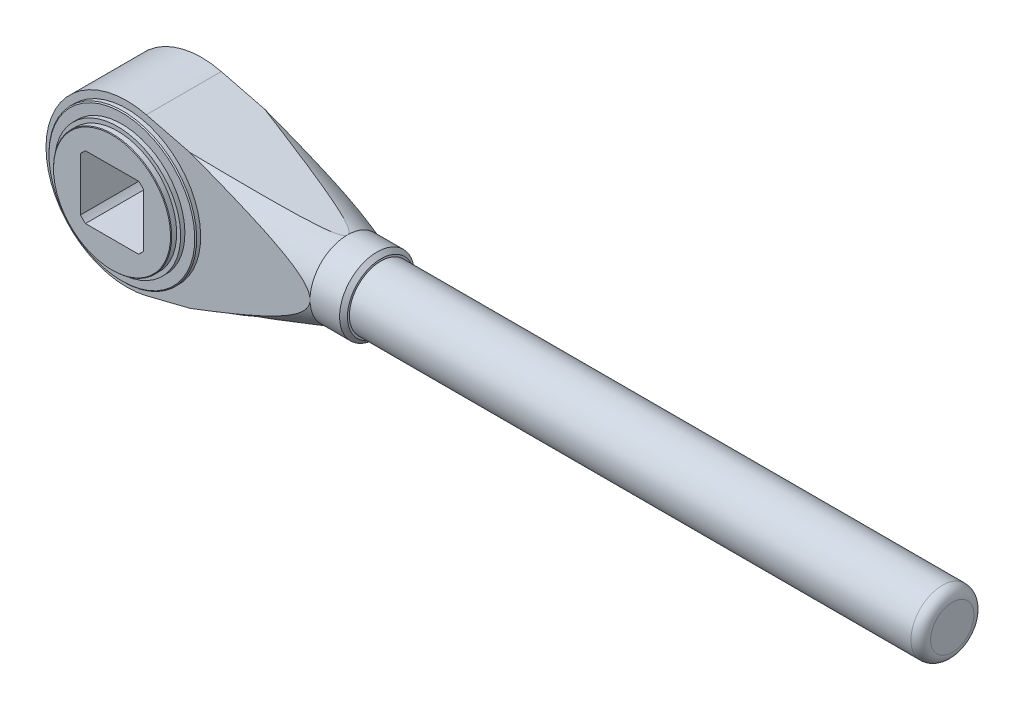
ISO-10303-21;
HEADER;
FILE_DESCRIPTION(('STEP AP214'),'2;1');
FILE_NAME('part.step','',(''),(''),'','','');
FILE_SCHEMA(('AUTOMOTIVE_DESIGN { 1 0 10303 214 1 1 1 1 }'));
ENDSEC;
DATA;
#1=APPLICATION_CONTEXT('core data for automotive mechanical design processes');
#2=APPLICATION_PROTOCOL_DEFINITION('international standard','automotive_design',2000,#1);
#3=PRODUCT_CONTEXT('',#1,'mechanical');
#4=PRODUCT('Part','Part','',(#3));
#5=PRODUCT_RELATED_PRODUCT_CATEGORY('part','',(#4));
#6=PRODUCT_DEFINITION_FORMATION('','',#4);
#7=PRODUCT_DEFINITION_CONTEXT('part definition',#1,'design');
#8=PRODUCT_DEFINITION('design','',#6,#7);
#9=PRODUCT_DEFINITION_SHAPE('','',#8);
#10=(LENGTH_UNIT() NAMED_UNIT(*) SI_UNIT(.MILLI.,.METRE.));
#11=(NAMED_UNIT(*) PLANE_ANGLE_UNIT() SI_UNIT($,.RADIAN.));
#12=(NAMED_UNIT(*) SI_UNIT($,.STERADIAN.) SOLID_ANGLE_UNIT());
#13=UNCERTAINTY_MEASURE_WITH_UNIT(LENGTH_MEASURE(1.E-05),#10,'distance_accuracy_value','');
#14=(GEOMETRIC_REPRESENTATION_CONTEXT(3) GLOBAL_UNCERTAINTY_ASSIGNED_CONTEXT((#13)) GLOBAL_UNIT_ASSIGNED_CONTEXT((#10,
#11,#12)) REPRESENTATION_CONTEXT('',''));
#15=CARTESIAN_POINT('',(0.,0.,0.));
#16=DIRECTION('',(0.,0.,1.));
#17=DIRECTION('',(1.,0.,0.));
#18=AXIS2_PLACEMENT_3D('',#15,#16,#17);
#19=CARTESIAN_POINT('',(93.,19.000000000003,45.5));
#20=DIRECTION('',(-0.242665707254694,-0.970109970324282,0.));
#21=DIRECTION('',(0.970109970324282,-0.242665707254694,0.));
#22=AXIS2_PLACEMENT_3D('',#19,#20,#21);
#23=PLANE('',#22);
#24=DIRECTION('',(-0.970109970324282,0.242665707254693,0.));
#25=VECTOR('',#24,1.);
#26=CARTESIAN_POINT('',(93.,19.000000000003,45.5));
#27=LINE('',#26,#25);
#28=CARTESIAN_POINT('',(32.074227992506,34.2401232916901,45.5));
#29=VERTEX_POINT('',#28);
#30=CARTESIAN_POINT('',(9.949294,39.7745090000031,45.5));
#31=VERTEX_POINT('',#30);
#32=EDGE_CURVE('E409',#29,#31,#27,.T.);
#33=ORIENTED_EDGE('',*,*,#32,.F.);
#34=CARTESIAN_POINT('',(32.073362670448,34.24033974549,45.5002));
#35=CARTESIAN_POINT('',(33.2265491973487,33.9518788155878,45.2336621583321));
#36=CARTESIAN_POINT('',(34.3795960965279,33.6634528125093,44.9664820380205));
#37=CARTESIAN_POINT('',(36.6853671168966,33.086681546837,44.4306372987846));
#38=CARTESIAN_POINT('',(37.8380912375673,32.798336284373,44.1619726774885));
#39=CARTESIAN_POINT('',(41.2966347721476,31.9332076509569,43.3532368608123));
#40=CARTESIAN_POINT('',(43.6018986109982,31.356563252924,42.8106375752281));
#41=CARTESIAN_POINT('',(48.232273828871,30.1983097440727,41.7112856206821));
#42=CARTESIAN_POINT('',(50.5573661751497,29.6167053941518,41.1544475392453));
#43=CARTESIAN_POINT('',(54.0423793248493,28.744955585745,40.3097099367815));
#44=CARTESIAN_POINT('',(55.203393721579,28.454536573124,40.0266050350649));
#45=CARTESIAN_POINT('',(57.5245206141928,27.8739241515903,39.4565341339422));
#46=CARTESIAN_POINT('',(58.6846331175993,27.5837307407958,39.1695681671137));
#47=CARTESIAN_POINT('',(61.0371363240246,26.9952697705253,38.5826091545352));
#48=CARTESIAN_POINT('',(62.2294948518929,26.697010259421,38.2824789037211));
#49=CARTESIAN_POINT('',(64.6127668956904,26.1008526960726,37.6760024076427));
#50=CARTESIAN_POINT('',(65.8036803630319,25.8029546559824,37.3696559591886));
#51=CARTESIAN_POINT('',(68.1849643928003,25.2072943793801,36.7486866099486));
#52=CARTESIAN_POINT('',(69.3753326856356,24.9095327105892,36.4340544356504));
#53=CARTESIAN_POINT('',(71.7533025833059,24.3147014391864,35.7944094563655));
#54=CARTESIAN_POINT('',(72.9409044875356,24.0176317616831,35.4693978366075));
#55=CARTESIAN_POINT('',(75.3058017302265,23.4260705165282,34.8071050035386));
#56=CARTESIAN_POINT('',(76.4831176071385,23.1315738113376,34.4699023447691));
#57=CARTESIAN_POINT('',(78.2451769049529,22.690807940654,33.9489678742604));
#58=CARTESIAN_POINT('',(78.8320121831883,22.5440155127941,33.7727590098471));
#59=CARTESIAN_POINT('',(80.0038831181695,22.2508808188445,33.4141321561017));
#60=CARTESIAN_POINT('',(80.5889188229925,22.1045385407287,33.2317143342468));
#61=CARTESIAN_POINT('',(81.7555136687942,21.8127236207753,32.8594718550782));
#62=CARTESIAN_POINT('',(82.3370773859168,21.6672498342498,32.669662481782));
#63=CARTESIAN_POINT('',(83.4970522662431,21.377090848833,32.2800816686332));
#64=CARTESIAN_POINT('',(84.0754635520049,21.2324056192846,32.0803106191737));
#65=CARTESIAN_POINT('',(85.2274038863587,20.9442564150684,31.6675910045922));
#66=CARTESIAN_POINT('',(85.800936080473,20.8007916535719,31.4546517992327));
#67=CARTESIAN_POINT('',(86.9411794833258,20.51556834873,31.0102649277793));
#68=CARTESIAN_POINT('',(87.5078925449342,20.3738093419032,30.7788224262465));
#69=CARTESIAN_POINT('',(88.2133358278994,20.1973480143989,30.4700471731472));
#70=CARTESIAN_POINT('',(88.3574834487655,20.1612905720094,30.4058503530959));
#71=CARTESIAN_POINT('',(88.644866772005,20.0894037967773,30.2752941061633));
#72=CARTESIAN_POINT('',(88.7881024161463,20.0535744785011,30.2089345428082));
#73=CARTESIAN_POINT('',(89.0735500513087,19.982171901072,30.0737365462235));
#74=CARTESIAN_POINT('',(89.21576155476,19.9465987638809,30.0048970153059));
#75=CARTESIAN_POINT('',(89.4988606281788,19.8757836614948,29.8643868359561));
#76=CARTESIAN_POINT('',(89.63974818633,19.8405416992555,29.7927161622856));
#77=CARTESIAN_POINT('',(90.0592203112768,19.735613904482,29.5732166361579));
#78=CARTESIAN_POINT('',(90.3354470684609,19.6665178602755,29.420512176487));
#79=CARTESIAN_POINT('',(90.8775296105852,19.530919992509,29.0971307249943));
#80=CARTESIAN_POINT('',(91.1433984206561,19.4644149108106,28.9264773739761));
#81=CARTESIAN_POINT('',(91.6030282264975,19.3494419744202,28.5967190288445));
#82=CARTESIAN_POINT('',(91.800159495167,19.3001310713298,28.4427866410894));
#83=CARTESIAN_POINT('',(92.0799516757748,19.23014316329,28.1936391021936));
#84=CARTESIAN_POINT('',(92.1703796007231,19.2075232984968,28.1077615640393));
#85=CARTESIAN_POINT('',(92.3438766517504,19.1641243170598,27.9285091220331));
#86=CARTESIAN_POINT('',(92.4269544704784,19.1433430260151,27.8351433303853));
#87=CARTESIAN_POINT('',(92.5706003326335,19.1074110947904,27.6543556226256));
#88=CARTESIAN_POINT('',(92.6326667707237,19.0918856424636,27.5682163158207));
#89=CARTESIAN_POINT('',(92.7462005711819,19.0634860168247,27.3885405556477));
#90=CARTESIAN_POINT('',(92.7976586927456,19.0506141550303,27.2949977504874));
#91=CARTESIAN_POINT('',(92.8863430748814,19.0284304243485,27.0990652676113));
#92=CARTESIAN_POINT('',(92.9233471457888,19.0191741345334,26.996565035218));
#93=CARTESIAN_POINT('',(92.9768803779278,19.0057831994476,26.7861203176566));
#94=CARTESIAN_POINT('',(92.99347538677,19.0016320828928,26.6781945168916));
#95=CARTESIAN_POINT('',(93.0027215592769,18.9993192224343,26.4751664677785));
#96=CARTESIAN_POINT('',(92.9981732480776,19.0004569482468,26.3801967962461));
#97=CARTESIAN_POINT('',(92.9721036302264,19.0069780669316,26.1927198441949));
#98=CARTESIAN_POINT('',(92.9505573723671,19.0123677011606,26.100216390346));
#99=CARTESIAN_POINT('',(92.8865398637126,19.0283811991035,25.8992128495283));
#100=CARTESIAN_POINT('',(92.840368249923,19.0399306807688,25.7919939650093));
#101=CARTESIAN_POINT('',(92.7323962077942,19.0669390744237,25.5863535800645));
#102=CARTESIAN_POINT('',(92.6705621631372,19.0824063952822,25.4879516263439));
#103=CARTESIAN_POINT('',(92.4791643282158,19.1302831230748,25.219229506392));
#104=CARTESIAN_POINT('',(92.3366962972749,19.1659204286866,25.0588511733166));
#105=CARTESIAN_POINT('',(92.0328141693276,19.2419342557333,24.7586739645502));
#106=CARTESIAN_POINT('',(91.8713340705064,19.2823272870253,24.61895081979));
#107=CARTESIAN_POINT('',(91.5521143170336,19.3621777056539,24.3661649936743));
#108=CARTESIAN_POINT('',(91.3953060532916,19.4014021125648,24.2518373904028));
#109=CARTESIAN_POINT('',(91.0755534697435,19.4813858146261,24.0326225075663));
#110=CARTESIAN_POINT('',(90.912605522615,19.522146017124,23.9277409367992));
#111=CARTESIAN_POINT('',(90.4167895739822,19.646170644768,23.6236025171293));
#112=CARTESIAN_POINT('',(90.0776089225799,19.7310141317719,23.4353395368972));
#113=CARTESIAN_POINT('',(89.3882600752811,19.9034495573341,23.0769005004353));
#114=CARTESIAN_POINT('',(89.0380408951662,19.9910542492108,22.9068318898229));
#115=CARTESIAN_POINT('',(88.3321979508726,20.1676155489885,22.5805967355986));
#116=CARTESIAN_POINT('',(87.9765826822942,20.2565700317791,22.4244105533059));
#117=CARTESIAN_POINT('',(87.2662963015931,20.4342428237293,22.1242560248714));
#118=CARTESIAN_POINT('',(86.9116798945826,20.5229474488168,21.9801488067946));
#119=CARTESIAN_POINT('',(86.1995947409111,20.7010701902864,21.6996020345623));
#120=CARTESIAN_POINT('',(85.8421258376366,20.7904883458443,21.56316290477));
#121=CARTESIAN_POINT('',(84.7663585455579,21.0595834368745,21.1628805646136));
#122=CARTESIAN_POINT('',(84.0448769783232,21.2400566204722,20.9081452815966));
#123=CARTESIAN_POINT('',(82.595679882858,21.6025623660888,20.4147940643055));
#124=CARTESIAN_POINT('',(81.8679569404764,21.7845967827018,20.1762016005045));
#125=CARTESIAN_POINT('',(80.409014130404,22.1495403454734,19.7110960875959));
#126=CARTESIAN_POINT('',(79.6777947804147,22.3324493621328,19.4845813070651));
#127=CARTESIAN_POINT('',(78.2154564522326,22.6982422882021,19.0414789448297));
#128=CARTESIAN_POINT('',(77.4843469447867,22.881123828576,18.8248579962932));
#129=CARTESIAN_POINT('',(76.0201618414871,23.2473787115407,18.3987131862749));
#130=CARTESIAN_POINT('',(75.2870861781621,23.4307520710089,18.189189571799));
#131=CARTESIAN_POINT('',(73.0867174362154,23.9811577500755,17.5693984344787));
#132=CARTESIAN_POINT('',(71.6171859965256,24.3487499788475,17.1675835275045));
#133=CARTESIAN_POINT('',(68.568155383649,25.1114420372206,16.3507928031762));
#134=CARTESIAN_POINT('',(66.9883705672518,25.5066133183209,15.9369585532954));
#135=CARTESIAN_POINT('',(63.8257701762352,26.2977140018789,15.1217138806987));
#136=CARTESIAN_POINT('',(62.2429545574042,26.6936434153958,14.7203036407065));
#137=CARTESIAN_POINT('',(59.0746094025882,27.4861811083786,13.9265133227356));
#138=CARTESIAN_POINT('',(57.4890791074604,27.8827895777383,13.5341364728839));
#139=CARTESIAN_POINT('',(54.3164020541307,28.676410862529,12.7563861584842));
#140=CARTESIAN_POINT('',(52.7292552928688,29.0734236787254,12.3710127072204));
#141=CARTESIAN_POINT('',(49.5539963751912,29.8676907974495,11.6058178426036));
#142=CARTESIAN_POINT('',(47.965884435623,30.2649450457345,11.2259954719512));
#143=CARTESIAN_POINT('',(44.788675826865,31.0596998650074,10.4707390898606));
#144=CARTESIAN_POINT('',(43.1995791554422,31.457200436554,10.0953050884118));
#145=CARTESIAN_POINT('',(40.0213274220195,32.2522161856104,9.34817488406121));
#146=CARTESIAN_POINT('',(38.4321727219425,32.649731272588,8.97647704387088));
#147=CARTESIAN_POINT('',(35.2532188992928,33.4449226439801,8.23605574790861));
#148=CARTESIAN_POINT('',(33.6634197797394,33.8425989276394,7.86733227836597));
#149=CARTESIAN_POINT('',(32.073362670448,34.24033974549,7.49979999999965));
#150=B_SPLINE_CURVE_WITH_KNOTS('',3,(#34,#35,#36,#37,#38,#39,#40,#41,#42,#43,#44,#45,#46,#47,
#48,#49,#50,#51,#52,#53,#54,#55,#56,#57,#58,#59,#60,#61,#62,#63,#64,#65,#66,#67,#68,#69,#70,#71,
#72,#73,#74,#75,#76,#77,#78,#79,#80,#81,#82,#83,#84,#85,#86,#87,#88,#89,#90,#91,#92,#93,#94,#95,
#96,#97,#98,#99,#100,#101,#102,#103,#104,#105,#106,#107,#108,#109,#110,#111,#112,#113,#114,#115,
#116,#117,#118,#119,#120,#121,#122,#123,#124,#125,#126,#127,#128,#129,#130,#131,#132,#133,#134,
#135,#136,#137,#138,#139,#140,#141,#142,#143,#144,#145,#146,#147,#148,#149),.UNSPECIFIED.,.F.,
.F.,(4,2,2,2,2,2,2,2,2,2,2,2,2,2,2,2,2,2,2,2,2,2,2,2,2,2,2,2,2,2,2,2,2,2,2,2,2,2,2,2,2,2,2,2,2,
2,2,2,2,2,2,2,2,2,2,2,2,4),(0.,3.6546984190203,7.30940267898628,14.6217480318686,
22.0034182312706,25.6928595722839,29.3822698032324,33.1778862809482,36.9736270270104,
40.7738135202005,44.5735676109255,48.3521261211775,50.2422755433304,52.1323740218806,
54.0187525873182,55.9050572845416,57.7900362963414,59.6744910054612,60.1600689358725,
60.6456775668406,61.1315038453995,61.6173344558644,62.5861716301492,63.553748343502,
64.3169800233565,64.6968935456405,65.076351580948,65.3976449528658,65.7192170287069,
66.0455542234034,66.3708357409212,66.6543555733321,66.9382923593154,67.2882447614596,
67.6389547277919,68.2876832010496,68.9387341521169,69.5322282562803,70.1260786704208,
71.3162792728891,72.5131600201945,73.7083197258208,74.8869847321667,76.0657149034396,
78.4237654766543,80.7851739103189,83.1462429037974,85.4986510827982,87.8511410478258,
92.5525910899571,97.5931910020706,102.633865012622,107.676313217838,112.718770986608,
117.760348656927,122.801937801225,127.841211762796,132.880462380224),.UNSPECIFIED.);
#151=CARTESIAN_POINT('',(93.,19.000000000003,26.5));
#152=VERTEX_POINT('',#151);
#153=EDGE_CURVE('E260',#29,#152,#150,.T.);
#154=ORIENTED_EDGE('',*,*,#153,.T.);
#155=CARTESIAN_POINT('',(32.074227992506,34.2401232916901,7.5));
#156=VERTEX_POINT('',#155);
#157=EDGE_CURVE('E225',#152,#156,#150,.T.);
#158=ORIENTED_EDGE('',*,*,#157,.T.);
#159=DIRECTION('',(-0.970109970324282,0.242665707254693,0.));
#160=VECTOR('',#159,1.);
#161=CARTESIAN_POINT('',(93.,19.000000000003,7.5));
#162=LINE('',#161,#160);
#163=CARTESIAN_POINT('',(9.949294,39.7745090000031,7.5));
#164=VERTEX_POINT('',#163);
#165=EDGE_CURVE('E419',#156,#164,#162,.T.);
#166=ORIENTED_EDGE('',*,*,#165,.T.);
#167=DIRECTION('',(0.,0.,-1.));
#168=VECTOR('',#167,1.);
#169=CARTESIAN_POINT('',(9.949294,39.7745090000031,45.5));
#170=LINE('',#169,#168);
#171=EDGE_CURVE('E401',#31,#164,#170,.T.);
#172=ORIENTED_EDGE('',*,*,#171,.F.);
#173=EDGE_LOOP('',(#33,#154,#158,#166,#172));
#174=FACE_BOUND('',#173,.T.);
#175=ADVANCED_FACE('F15',(#174),#23,.F.);
#176=CARTESIAN_POINT('',(0.,3.05311331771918E-12,45.5));
#177=DIRECTION('',(0.,0.,-1.));
#178=DIRECTION('',(-1.,0.,0.));
#179=AXIS2_PLACEMENT_3D('',#176,#177,#178);
#180=CYLINDRICAL_SURFACE('',#179,41.0000002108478);
#181=DIRECTION('',(0.,0.,-1.));
#182=VECTOR('',#181,1.);
#183=CARTESIAN_POINT('',(9.949294,-39.7745089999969,45.5));
#184=LINE('',#183,#182);
#185=CARTESIAN_POINT('',(9.949294,-39.7745089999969,45.5));
#186=VERTEX_POINT('',#185);
#187=CARTESIAN_POINT('',(9.949294,-39.7745089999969,7.5));
#188=VERTEX_POINT('',#187);
#189=EDGE_CURVE('E405',#186,#188,#184,.T.);
#190=ORIENTED_EDGE('',*,*,#189,.F.);
#191=CARTESIAN_POINT('',(0.,3.05311331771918E-12,45.5));
#192=DIRECTION('',(0.,0.,1.));
#193=DIRECTION('',(1.,0.,0.));
#194=AXIS2_PLACEMENT_3D('',#191,#192,#193);
#195=CIRCLE('',#194,41.0000002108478);
#196=EDGE_CURVE('E412',#31,#186,#195,.T.);
#197=ORIENTED_EDGE('',*,*,#196,.F.);
#198=ORIENTED_EDGE('',*,*,#171,.T.);
#199=CARTESIAN_POINT('',(0.,3.05311331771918E-12,7.5));
#200=DIRECTION('',(0.,0.,1.));
#201=DIRECTION('',(1.,0.,0.));
#202=AXIS2_PLACEMENT_3D('',#199,#200,#201);
#203=CIRCLE('',#202,41.0000002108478);
#204=EDGE_CURVE('E422',#164,#188,#203,.T.);
#205=ORIENTED_EDGE('',*,*,#204,.T.);
#206=EDGE_LOOP('',(#190,#197,#198,#205));
#207=FACE_BOUND('',#206,.T.);
#208=ADVANCED_FACE('F268',(#207),#180,.T.);
#209=CARTESIAN_POINT('',(93.,-18.9999999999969,45.5));
#210=DIRECTION('',(0.242665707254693,-0.970109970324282,0.));
#211=DIRECTION('',(0.970109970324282,0.242665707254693,0.));
#212=AXIS2_PLACEMENT_3D('',#209,#210,#211);
#213=PLANE('',#212);
#214=CARTESIAN_POINT('',(32.073362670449,-34.2403397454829,45.5002));
#215=CARTESIAN_POINT('',(33.2265491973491,-33.9518788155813,45.2336621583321));
#216=CARTESIAN_POINT('',(34.3795960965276,-33.6634528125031,44.9664820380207));
#217=CARTESIAN_POINT('',(36.685367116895,-33.0866815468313,44.4306372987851));
#218=CARTESIAN_POINT('',(37.838091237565,-32.7983362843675,44.1619726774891));
#219=CARTESIAN_POINT('',(41.2966347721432,-31.9332076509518,43.3532368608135));
#220=CARTESIAN_POINT('',(43.6018986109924,-31.3565632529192,42.8106375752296));
#221=CARTESIAN_POINT('',(48.2322738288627,-30.1983097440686,41.7112856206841));
#222=CARTESIAN_POINT('',(50.5573661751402,-29.616705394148,41.1544475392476));
#223=CARTESIAN_POINT('',(54.0423793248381,-28.7449555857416,40.3097099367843));
#224=CARTESIAN_POINT('',(55.2033937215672,-28.4545365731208,40.0266050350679));
#225=CARTESIAN_POINT('',(57.5245206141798,-27.8739241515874,39.4565341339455));
#226=CARTESIAN_POINT('',(58.6846331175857,-27.5837307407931,39.1695681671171));
#227=CARTESIAN_POINT('',(61.0371363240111,-26.9952697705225,38.5826091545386));
#228=CARTESIAN_POINT('',(62.22949485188,-26.6970102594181,38.2824789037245));
#229=CARTESIAN_POINT('',(64.6127668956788,-26.1008526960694,37.6760024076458));
#230=CARTESIAN_POINT('',(65.8036803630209,-25.802954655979,37.3696559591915));
#231=CARTESIAN_POINT('',(68.1849643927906,-25.2072943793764,36.7486866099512));
#232=CARTESIAN_POINT('',(69.3753326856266,-24.9095327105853,36.4340544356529));
#233=CARTESIAN_POINT('',(71.7533025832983,-24.3147014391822,35.7944094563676));
#234=CARTESIAN_POINT('',(72.9409044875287,-24.0176317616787,35.4693978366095));
#235=CARTESIAN_POINT('',(75.3058017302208,-23.4260705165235,34.8071050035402));
#236=CARTESIAN_POINT('',(76.4831176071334,-23.1315738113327,34.4699023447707));
#237=CARTESIAN_POINT('',(78.2451769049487,-22.6908079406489,33.9489678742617));
#238=CARTESIAN_POINT('',(78.8320121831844,-22.5440155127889,33.7727590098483));
#239=CARTESIAN_POINT('',(80.0038831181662,-22.2508808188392,33.4141321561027));
#240=CARTESIAN_POINT('',(80.5889188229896,-22.1045385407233,33.2317143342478));
#241=CARTESIAN_POINT('',(81.7555136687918,-21.8127236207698,32.859471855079));
#242=CARTESIAN_POINT('',(82.3370773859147,-21.6672498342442,32.6696624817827));
#243=CARTESIAN_POINT('',(83.4970522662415,-21.3770908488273,32.2800816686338));
#244=CARTESIAN_POINT('',(84.0754635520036,-21.2324056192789,32.0803106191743));
#245=CARTESIAN_POINT('',(85.2274038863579,-20.9442564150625,31.6675910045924));
#246=CARTESIAN_POINT('',(85.8009360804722,-20.8007916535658,31.4546517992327));
#247=CARTESIAN_POINT('',(86.9411794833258,-20.515568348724,31.0102649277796));
#248=CARTESIAN_POINT('',(87.5078925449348,-20.3738093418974,30.7788224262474));
#249=CARTESIAN_POINT('',(88.2133358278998,-20.1973480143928,30.4700471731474));
#250=CARTESIAN_POINT('',(88.3574834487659,-20.1612905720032,30.4058503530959));
#251=CARTESIAN_POINT('',(88.6448667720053,-20.0894037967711,30.275294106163));
#252=CARTESIAN_POINT('',(88.7881024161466,-20.0535744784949,30.208934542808));
#253=CARTESIAN_POINT('',(89.0735500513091,-19.9821719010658,30.0737365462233));
#254=CARTESIAN_POINT('',(89.2157615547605,-19.9465987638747,30.0048970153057));
#255=CARTESIAN_POINT('',(89.4988606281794,-19.8757836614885,29.8643868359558));
#256=CARTESIAN_POINT('',(89.6397481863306,-19.8405416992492,29.7927161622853));
#257=CARTESIAN_POINT('',(90.0592203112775,-19.7356139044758,29.5732166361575));
#258=CARTESIAN_POINT('',(90.3354470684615,-19.6665178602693,29.4205121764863));
#259=CARTESIAN_POINT('',(90.877529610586,-19.5309199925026,29.0971307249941));
#260=CARTESIAN_POINT('',(91.1433984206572,-19.464414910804,28.9264773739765));
#261=CARTESIAN_POINT('',(91.6030282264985,-19.3494419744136,28.5967190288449));
#262=CARTESIAN_POINT('',(91.8001594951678,-19.3001310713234,28.4427866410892));
#263=CARTESIAN_POINT('',(92.0799516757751,-19.2301431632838,28.1936391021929));
#264=CARTESIAN_POINT('',(92.1703796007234,-19.2075232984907,28.1077615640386));
#265=CARTESIAN_POINT('',(92.3438766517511,-19.1641243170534,27.9285091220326));
#266=CARTESIAN_POINT('',(92.4269544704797,-19.1433430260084,27.8351433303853));
#267=CARTESIAN_POINT('',(92.5706003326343,-19.1074110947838,27.6543556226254));
#268=CARTESIAN_POINT('',(92.6326667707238,-19.0918856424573,27.56821631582));
#269=CARTESIAN_POINT('',(92.7462005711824,-19.0634860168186,27.388540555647));
#270=CARTESIAN_POINT('',(92.7976586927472,-19.0506141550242,27.2949977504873));
#271=CARTESIAN_POINT('',(92.8863430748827,-19.0284304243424,27.0990652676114));
#272=CARTESIAN_POINT('',(92.9233471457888,-19.0191741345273,26.9965650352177));
#273=CARTESIAN_POINT('',(92.9768803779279,-19.0057831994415,26.7861203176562));
#274=CARTESIAN_POINT('',(92.9934753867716,-19.0016320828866,26.6781945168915));
#275=CARTESIAN_POINT('',(93.0027215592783,-18.9993192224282,26.4751664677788));
#276=CARTESIAN_POINT('',(92.9981732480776,-19.0004569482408,26.3801967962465));
#277=CARTESIAN_POINT('',(92.9721036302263,-19.0069780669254,26.1927198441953));
#278=CARTESIAN_POINT('',(92.9505573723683,-19.0123677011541,26.1002163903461));
#279=CARTESIAN_POINT('',(92.8865398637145,-19.0283811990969,25.8992128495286));
#280=CARTESIAN_POINT('',(92.8403682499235,-19.0399306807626,25.7919939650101));
#281=CARTESIAN_POINT('',(92.7323962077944,-19.0669390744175,25.5863535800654));
#282=CARTESIAN_POINT('',(92.6705621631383,-19.0824063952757,25.4879516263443));
#283=CARTESIAN_POINT('',(92.4791643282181,-19.130283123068,25.219229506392));
#284=CARTESIAN_POINT('',(92.3366962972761,-19.1659204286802,25.0588511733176));
#285=CARTESIAN_POINT('',(92.0328141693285,-19.241934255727,24.7586739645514));
#286=CARTESIAN_POINT('',(91.8713340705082,-19.2823272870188,24.6189508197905));
#287=CARTESIAN_POINT('',(91.5521143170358,-19.3621777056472,24.3661649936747));
#288=CARTESIAN_POINT('',(91.3953060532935,-19.4014021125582,24.2518373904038));
#289=CARTESIAN_POINT('',(91.0755534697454,-19.4813858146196,24.0326225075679));
#290=CARTESIAN_POINT('',(90.9126055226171,-19.5221460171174,23.9277409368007));
#291=CARTESIAN_POINT('',(90.4167895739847,-19.6461706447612,23.6236025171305));
#292=CARTESIAN_POINT('',(90.0776089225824,-19.7310141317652,23.4353395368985));
#293=CARTESIAN_POINT('',(89.3882600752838,-19.9034495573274,23.0769005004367));
#294=CARTESIAN_POINT('',(89.0380408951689,-19.991054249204,22.9068318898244));
#295=CARTESIAN_POINT('',(88.3321979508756,-20.1676155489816,22.5805967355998));
#296=CARTESIAN_POINT('',(87.9765826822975,-20.2565700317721,22.4244105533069));
#297=CARTESIAN_POINT('',(87.2662963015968,-20.4342428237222,22.1242560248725));
#298=CARTESIAN_POINT('',(86.9116798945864,-20.5229474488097,21.980148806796));
#299=CARTESIAN_POINT('',(86.1995947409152,-20.7010701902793,21.699602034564));
#300=CARTESIAN_POINT('',(85.8421258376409,-20.7904883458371,21.5631629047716));
#301=CARTESIAN_POINT('',(84.7663585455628,-21.0595834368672,21.1628805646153));
#302=CARTESIAN_POINT('',(84.0448769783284,-21.2400566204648,20.9081452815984));
#303=CARTESIAN_POINT('',(82.5956798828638,-21.6025623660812,20.4147940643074));
#304=CARTESIAN_POINT('',(81.8679569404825,-21.7845967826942,20.1762016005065));
#305=CARTESIAN_POINT('',(80.4090141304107,-22.1495403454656,19.7110960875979));
#306=CARTESIAN_POINT('',(79.6777947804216,-22.3324493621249,19.4845813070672));
#307=CARTESIAN_POINT('',(78.2154564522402,-22.6982422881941,19.041478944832));
#308=CARTESIAN_POINT('',(77.4843469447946,-22.8811238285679,18.8248579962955));
#309=CARTESIAN_POINT('',(76.0201618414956,-23.2473787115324,18.3987131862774));
#310=CARTESIAN_POINT('',(75.287086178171,-23.4307520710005,18.1891895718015));
#311=CARTESIAN_POINT('',(73.0867174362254,-23.9811577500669,17.5693984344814));
#312=CARTESIAN_POINT('',(71.6171859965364,-24.3487499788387,17.1675835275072));
#313=CARTESIAN_POINT('',(68.5681553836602,-25.1114420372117,16.3507928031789));
#314=CARTESIAN_POINT('',(66.9883705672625,-25.5066133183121,15.9369585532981));
#315=CARTESIAN_POINT('',(63.8257701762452,-26.2977140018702,15.1217138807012));
#316=CARTESIAN_POINT('',(62.2429545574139,-26.6936434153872,14.7203036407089));
#317=CARTESIAN_POINT('',(59.0746094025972,-27.4861811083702,13.9265133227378));
#318=CARTESIAN_POINT('',(57.4890791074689,-27.8827895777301,13.5341364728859));
#319=CARTESIAN_POINT('',(54.3164020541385,-28.6764108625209,12.756386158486));
#320=CARTESIAN_POINT('',(52.7292552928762,-29.0734236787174,12.3710127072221));
#321=CARTESIAN_POINT('',(49.5539963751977,-29.8676907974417,11.6058178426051));
#322=CARTESIAN_POINT('',(47.965884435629,-30.2649450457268,11.2259954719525));
#323=CARTESIAN_POINT('',(44.78867582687,-31.059699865,10.4707390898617));
#324=CARTESIAN_POINT('',(43.1995791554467,-31.4572004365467,10.0953050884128));
#325=CARTESIAN_POINT('',(40.021327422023,-32.2522161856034,9.34817488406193));
#326=CARTESIAN_POINT('',(38.4321727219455,-32.6497312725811,8.97647704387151));
#327=CARTESIAN_POINT('',(35.2532188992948,-33.4449226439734,8.23605574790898));
#328=CARTESIAN_POINT('',(33.663419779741,-33.8425989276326,7.86733227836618));
#329=CARTESIAN_POINT('',(32.073362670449,-34.2403397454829,7.4997999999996));
#330=B_SPLINE_CURVE_WITH_KNOTS('',3,(#214,#215,#216,#217,#218,#219,#220,#221,#222,#223,#224,
#225,#226,#227,#228,#229,#230,#231,#232,#233,#234,#235,#236,#237,#238,#239,#240,#241,#242,#243,
#244,#245,#246,#247,#248,#249,#250,#251,#252,#253,#254,#255,#256,#257,#258,#259,#260,#261,#262,
#263,#264,#265,#266,#267,#268,#269,#270,#271,#272,#273,#274,#275,#276,#277,#278,#279,#280,#281,
#282,#283,#284,#285,#286,#287,#288,#289,#290,#291,#292,#293,#294,#295,#296,#297,#298,#299,#300,
#301,#302,#303,#304,#305,#306,#307,#308,#309,#310,#311,#312,#313,#314,#315,#316,#317,#318,#319,
#320,#321,#322,#323,#324,#325,#326,#327,#328,#329),.UNSPECIFIED.,.F.,.F.,(4,2,2,2,2,2,2,2,2,2,2,
2,2,2,2,2,2,2,2,2,2,2,2,2,2,2,2,2,2,2,2,2,2,2,2,2,2,2,2,2,2,2,2,2,2,2,2,2,2,2,2,2,2,2,2,2,2,4),
(0.,3.6546984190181,7.30940267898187,14.6217480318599,22.0034182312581,25.6928595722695,
29.3822698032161,33.1778862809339,36.9736270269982,40.7738135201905,44.5735676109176,
48.3521261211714,50.2422755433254,52.1323740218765,54.018752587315,55.9050572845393,
57.7900362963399,59.6744910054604,60.1600689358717,60.6456775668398,61.1315038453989,
61.6173344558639,62.5861716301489,63.5537483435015,64.3169800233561,64.6968935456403,
65.0763515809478,65.3976449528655,65.7192170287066,66.0455542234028,66.3708357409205,
66.6543555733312,66.9382923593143,67.2882447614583,67.6389547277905,68.2876832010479,
68.9387341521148,69.5322282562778,70.126078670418,71.316279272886,72.5131600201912,
73.7083197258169,74.8869847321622,76.0657149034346,78.4237654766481,80.785173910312,
83.1462429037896,85.4986510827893,87.8511410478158,92.5525910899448,97.5931910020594,
102.633865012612,107.67631321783,112.7187709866,117.760348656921,122.801937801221,
127.841211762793,132.880462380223),.UNSPECIFIED.);
#331=CARTESIAN_POINT('',(32.0742279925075,-34.2401232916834,45.5));
#332=VERTEX_POINT('',#331);
#333=CARTESIAN_POINT('',(93.,-18.9999999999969,26.5));
#334=VERTEX_POINT('',#333);
#335=EDGE_CURVE('E224',#332,#334,#330,.T.);
#336=ORIENTED_EDGE('',*,*,#335,.F.);
#337=DIRECTION('',(-0.970109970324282,-0.242665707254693,0.));
#338=VECTOR('',#337,1.);
#339=CARTESIAN_POINT('',(93.,-18.9999999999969,45.5));
#340=LINE('',#339,#338);
#341=EDGE_CURVE('E416',#332,#186,#340,.T.);
#342=ORIENTED_EDGE('',*,*,#341,.T.);
#343=ORIENTED_EDGE('',*,*,#189,.T.);
#344=DIRECTION('',(-0.970109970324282,-0.242665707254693,0.));
#345=VECTOR('',#344,1.);
#346=CARTESIAN_POINT('',(93.,-18.9999999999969,7.5));
#347=LINE('',#346,#345);
#348=CARTESIAN_POINT('',(32.0742279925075,-34.2401232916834,7.5));
#349=VERTEX_POINT('',#348);
#350=EDGE_CURVE('E426',#349,#188,#347,.T.);
#351=ORIENTED_EDGE('',*,*,#350,.F.);
#352=EDGE_CURVE('E216',#334,#349,#330,.T.);
#353=ORIENTED_EDGE('',*,*,#352,.F.);
#354=EDGE_LOOP('',(#336,#342,#343,#351,#353));
#355=FACE_BOUND('',#354,.T.);
#356=ADVANCED_FACE('F232',(#355),#213,.T.);
#357=CARTESIAN_POINT('',(0.,3.05311331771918E-12,45.5));
#358=DIRECTION('',(0.,0.,1.));
#359=DIRECTION('',(1.,0.,0.));
#360=AXIS2_PLACEMENT_3D('',#357,#358,#359);
#361=PLANE('',#360);
#362=CARTESIAN_POINT('',(-25.003689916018,-54.8460012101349,45.5));
#363=CARTESIAN_POINT('',(-22.669895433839,-54.0287766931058,45.5));
#364=CARTESIAN_POINT('',(-20.3366976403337,-53.2098447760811,45.5));
#365=CARTESIAN_POINT('',(-15.6717005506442,-51.5679772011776,45.5));
#366=CARTESIAN_POINT('',(-13.3399012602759,-50.7450415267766,45.5));
#367=CARTESIAN_POINT('',(-8.67493215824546,-49.0935244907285,45.5));
#368=CARTESIAN_POINT('',(-6.34176443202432,-48.2649372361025,45.5));
#369=CARTESIAN_POINT('',(-1.67734115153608,-46.6024167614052,45.5));
#370=CARTESIAN_POINT('',(0.653914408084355,-45.7684835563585,45.5));
#371=CARTESIAN_POINT('',(5.35857887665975,-44.0784004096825,45.5));
#372=CARTESIAN_POINT('',(7.73194450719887,-43.2221299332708,45.5));
#373=CARTESIAN_POINT('',(12.4758734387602,-41.5018625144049,45.5));
#374=CARTESIAN_POINT('',(14.8464367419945,-40.6378655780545,45.5));
#375=CARTESIAN_POINT('',(19.5812508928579,-38.9016545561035,45.5));
#376=CARTESIAN_POINT('',(21.9455059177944,-38.0294518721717,45.5));
#377=CARTESIAN_POINT('',(26.6697622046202,-36.2737867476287,45.5));
#378=CARTESIAN_POINT('',(29.0297635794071,-35.390324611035,45.5));
#379=CARTESIAN_POINT('',(33.7394706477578,-33.6113499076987,45.5));
#380=CARTESIAN_POINT('',(36.0891875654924,-32.7158671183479,45.5));
#381=CARTESIAN_POINT('',(39.6088064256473,-31.3594205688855,45.5));
#382=CARTESIAN_POINT('',(40.7812479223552,-30.9050438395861,45.5));
#383=CARTESIAN_POINT('',(43.1241814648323,-29.9912939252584,45.5));
#384=CARTESIAN_POINT('',(44.2946735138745,-29.5319207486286,45.5));
#385=CARTESIAN_POINT('',(46.6378206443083,-28.6057354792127,45.5));
#386=CARTESIAN_POINT('',(47.8104672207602,-28.1389018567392,45.5));
#387=CARTESIAN_POINT('',(50.1531104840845,-27.1986377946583,45.5));
#388=CARTESIAN_POINT('',(51.3231071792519,-26.7252073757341,45.5));
#389=CARTESIAN_POINT('',(53.6595721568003,-25.7708624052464,45.5));
#390=CARTESIAN_POINT('',(54.8260415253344,-25.2899505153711,45.5));
#391=CARTESIAN_POINT('',(57.1552475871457,-24.3191804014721,45.5));
#392=CARTESIAN_POINT('',(58.3179843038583,-23.8293222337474,45.5));
#393=CARTESIAN_POINT('',(60.6305492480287,-22.8425935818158,45.5));
#394=CARTESIAN_POINT('',(61.780410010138,-22.3457994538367,45.5));
#395=CARTESIAN_POINT('',(64.0746902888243,-21.3396942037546,45.5));
#396=CARTESIAN_POINT('',(65.2191096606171,-20.8303827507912,45.5));
#397=CARTESIAN_POINT('',(67.5026698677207,-19.7958298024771,45.5));
#398=CARTESIAN_POINT('',(68.6418010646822,-19.2705669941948,45.5));
#399=CARTESIAN_POINT('',(70.9111230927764,-18.2012151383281,45.5));
#400=CARTESIAN_POINT('',(72.0413146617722,-17.6571276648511,45.5));
#401=CARTESIAN_POINT('',(73.7238226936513,-16.8249675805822,45.5));
#402=CARTESIAN_POINT('',(74.2806030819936,-16.5459132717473,45.5));
#403=CARTESIAN_POINT('',(75.3907339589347,-15.9810706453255,45.5));
#404=CARTESIAN_POINT('',(75.9440844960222,-15.6952824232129,45.5));
#405=CARTESIAN_POINT('',(77.046955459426,-15.1158892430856,45.5));
#406=CARTESIAN_POINT('',(77.5964743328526,-14.8222813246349,45.5));
#407=CARTESIAN_POINT('',(78.6906603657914,-14.2261610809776,45.5));
#408=CARTESIAN_POINT('',(79.2353275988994,-13.9236488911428,45.5));
#409=CARTESIAN_POINT('',(80.3174518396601,-13.3089850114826,45.5));
#410=CARTESIAN_POINT('',(80.8549231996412,-12.9968586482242,45.5));
#411=CARTESIAN_POINT('',(81.9226619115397,-12.3603901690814,45.5));
#412=CARTESIAN_POINT('',(82.4529287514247,-12.0360471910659,45.5));
#413=CARTESIAN_POINT('',(83.5039318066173,-11.3730366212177,45.5));
#414=CARTESIAN_POINT('',(84.0246744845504,-11.0343793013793,45.5));
#415=CARTESIAN_POINT('',(85.0542698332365,-10.3395091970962,45.5));
#416=CARTESIAN_POINT('',(85.5631249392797,-9.98330005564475,45.5));
#417=CARTESIAN_POINT('',(86.1923361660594,-9.52226398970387,45.5));
#418=CARTESIAN_POINT('',(86.3201253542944,-9.42753835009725,45.5));
#419=CARTESIAN_POINT('',(86.57457099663,-9.236573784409,45.5));
#420=CARTESIAN_POINT('',(86.701227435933,-9.14033483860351,45.5));
#421=CARTESIAN_POINT('',(87.0793844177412,-8.84920000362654,45.5));
#422=CARTESIAN_POINT('',(87.3290475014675,-8.65190446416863,45.5));
#423=CARTESIAN_POINT('',(87.822877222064,-8.24985734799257,45.5));
#424=CARTESIAN_POINT('',(88.0670358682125,-8.04509593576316,45.5));
#425=CARTESIAN_POINT('',(88.5483122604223,-7.62745208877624,45.5));
#426=CARTESIAN_POINT('',(88.7854303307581,-7.41457002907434,45.5));
#427=CARTESIAN_POINT('',(89.2485556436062,-6.98199042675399,45.5));
#428=CARTESIAN_POINT('',(89.4746561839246,-6.76239316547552,45.5));
#429=CARTESIAN_POINT('',(89.9165259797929,-6.31305276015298,45.5));
#430=CARTESIAN_POINT('',(90.1322968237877,-6.08331118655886,45.5));
#431=CARTESIAN_POINT('',(90.5506055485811,-5.61280545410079,45.5));
#432=CARTESIAN_POINT('',(90.7531680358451,-5.37206330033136,45.5));
#433=CARTESIAN_POINT('',(91.1421038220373,-4.87792755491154,45.5));
#434=CARTESIAN_POINT('',(91.3284859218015,-4.6245409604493,45.5));
#435=CARTESIAN_POINT('',(91.6282107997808,-4.18152813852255,45.5));
#436=CARTESIAN_POINT('',(91.7467531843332,-3.99543660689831,45.5));
#437=CARTESIAN_POINT('',(91.9718782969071,-3.61621485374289,45.5));
#438=CARTESIAN_POINT('',(92.0784606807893,-3.42308442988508,45.5));
#439=CARTESIAN_POINT('',(92.3770550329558,-2.8327755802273,45.5));
#440=CARTESIAN_POINT('',(92.5481853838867,-2.42429292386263,45.5));
#441=CARTESIAN_POINT('',(92.7371957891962,-1.82827045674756,45.5));
#442=CARTESIAN_POINT('',(92.7863322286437,-1.65033464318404,45.5));
#443=CARTESIAN_POINT('',(92.8701071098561,-1.29111460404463,45.5));
#444=CARTESIAN_POINT('',(92.904753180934,-1.10983219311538,45.5));
#445=CARTESIAN_POINT('',(92.958494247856,-0.745117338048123,45.5));
#446=CARTESIAN_POINT('',(92.9776017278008,-0.56168674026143,45.5));
#447=CARTESIAN_POINT('',(92.9997000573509,-0.193844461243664,45.5));
#448=CARTESIAN_POINT('',(93.0026907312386,-0.00943276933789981,45.5));
#449=CARTESIAN_POINT('',(92.9924480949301,0.35906406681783,45.5));
#450=CARTESIAN_POINT('',(92.9792034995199,0.543148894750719,45.5));
#451=CARTESIAN_POINT('',(92.9369127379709,0.909475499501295,45.5));
#452=CARTESIAN_POINT('',(92.9078666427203,1.09171728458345,45.5));
#453=CARTESIAN_POINT('',(92.8348382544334,1.45331887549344,45.5));
#454=CARTESIAN_POINT('',(92.7908442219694,1.63267629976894,45.5));
#455=CARTESIAN_POINT('',(92.6891504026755,1.98750274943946,45.5));
#456=CARTESIAN_POINT('',(92.6314428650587,2.1629695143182,45.5));
#457=CARTESIAN_POINT('',(92.3835525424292,2.83494350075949,45.5));
#458=CARTESIAN_POINT('',(92.1481762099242,3.31524437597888,45.5));
#459=CARTESIAN_POINT('',(91.7430324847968,4.0035085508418,45.5));
#460=CARTESIAN_POINT('',(91.5990287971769,4.22790289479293,45.5));
#461=CARTESIAN_POINT('',(91.2966333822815,4.6668655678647,45.5));
#462=CARTESIAN_POINT('',(91.1382435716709,4.8814352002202,45.5));
#463=CARTESIAN_POINT('',(90.7669410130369,5.35609378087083,45.5));
#464=CARTESIAN_POINT('',(90.5505810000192,5.61346181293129,45.5));
#465=CARTESIAN_POINT('',(90.1032757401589,6.11528212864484,45.5));
#466=CARTESIAN_POINT('',(89.8723246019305,6.35972912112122,45.5));
#467=CARTESIAN_POINT('',(89.3985684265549,6.837533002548,45.5));
#468=CARTESIAN_POINT('',(89.1557457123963,7.07087226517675,45.5));
#469=CARTESIAN_POINT('',(88.6608200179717,7.52750444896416,45.5));
#470=CARTESIAN_POINT('',(88.4087159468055,7.75079618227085,45.5));
#471=CARTESIAN_POINT('',(87.8952746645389,8.18998675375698,45.5));
#472=CARTESIAN_POINT('',(87.6338873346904,8.40582678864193,45.5));
#473=CARTESIAN_POINT('',(87.104807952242,8.8296261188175,45.5));
#474=CARTESIAN_POINT('',(86.8371157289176,9.03758520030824,45.5));
#475=CARTESIAN_POINT('',(86.2967554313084,9.44631995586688,45.5));
#476=CARTESIAN_POINT('',(86.0240928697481,9.64710293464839,45.5));
#477=CARTESIAN_POINT('',(85.4743398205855,10.0424752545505,45.5));
#478=CARTESIAN_POINT('',(85.1972494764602,10.2370647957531,45.5));
#479=CARTESIAN_POINT('',(84.3113718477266,10.8462524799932,45.5));
#480=CARTESIAN_POINT('',(83.695529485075,11.2506082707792,45.5));
#481=CARTESIAN_POINT('',(82.4507706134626,12.0387483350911,45.5));
#482=CARTESIAN_POINT('',(81.8218515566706,12.4225285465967,45.5));
#483=CARTESIAN_POINT('',(80.5536923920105,13.1735982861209,45.5));
#484=CARTESIAN_POINT('',(79.9144455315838,13.5408763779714,45.5));
#485=CARTESIAN_POINT('',(78.6282718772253,14.261569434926,45.5));
#486=CARTESIAN_POINT('',(77.9813456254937,14.6149853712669,45.5));
#487=CARTESIAN_POINT('',(76.6796199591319,15.3111317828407,45.5));
#488=CARTESIAN_POINT('',(76.0248044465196,15.6538320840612,45.5));
#489=CARTESIAN_POINT('',(74.7100967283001,16.329356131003,45.5));
#490=CARTESIAN_POINT('',(74.0502044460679,16.6621797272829,45.5));
#491=CARTESIAN_POINT('',(72.7264703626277,17.3192252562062,45.5));
#492=CARTESIAN_POINT('',(72.0626301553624,17.6434504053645,45.5));
#493=CARTESIAN_POINT('',(70.7314123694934,18.2845660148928,45.5));
#494=CARTESIAN_POINT('',(70.0640347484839,18.6014563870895,45.5));
#495=CARTESIAN_POINT('',(68.7244753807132,19.2296707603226,45.5));
#496=CARTESIAN_POINT('',(68.0522855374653,19.5409774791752,45.5));
#497=CARTESIAN_POINT('',(66.7053042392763,20.157914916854,45.5));
#498=CARTESIAN_POINT('',(66.0305127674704,20.4635455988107,45.5));
#499=CARTESIAN_POINT('',(64.0026669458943,21.3729651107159,45.5));
#500=CARTESIAN_POINT('',(62.6462388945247,21.9692358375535,45.5));
#501=CARTESIAN_POINT('',(59.9286893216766,23.1448330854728,45.5));
#502=CARTESIAN_POINT('',(58.5675789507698,23.7241854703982,45.5));
#503=CARTESIAN_POINT('',(56.5218416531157,24.5834340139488,45.5));
#504=CARTESIAN_POINT('',(55.8392612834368,24.8682158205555,45.5));
#505=CARTESIAN_POINT('',(54.4728699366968,25.4348116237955,45.5));
#506=CARTESIAN_POINT('',(53.7890589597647,25.7166256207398,45.5));
#507=CARTESIAN_POINT('',(51.725956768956,26.5621233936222,45.5));
#508=CARTESIAN_POINT('',(50.344973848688,27.1216814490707,45.5));
#509=CARTESIAN_POINT('',(47.5793229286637,28.2316236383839,45.5));
#510=CARTESIAN_POINT('',(46.1946549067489,28.7820077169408,45.5));
#511=CARTESIAN_POINT('',(43.4222165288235,29.874994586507,45.5));
#512=CARTESIAN_POINT('',(42.0344461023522,30.4175971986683,45.5));
#513=CARTESIAN_POINT('',(39.2563145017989,31.4961175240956,45.5));
#514=CARTESIAN_POINT('',(37.8659533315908,32.0320352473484,45.5));
#515=CARTESIAN_POINT('',(35.0828917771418,33.0981365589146,45.5));
#516=CARTESIAN_POINT('',(33.6901911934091,33.6283196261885,45.5));
#517=CARTESIAN_POINT('',(30.9028782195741,34.6836380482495,45.5));
#518=CARTESIAN_POINT('',(29.5082658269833,35.2087733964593,45.5));
#519=CARTESIAN_POINT('',(25.3219392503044,36.7775624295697,45.5));
#520=CARTESIAN_POINT('',(22.5277428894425,37.8145963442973,45.5));
#521=CARTESIAN_POINT('',(18.3311244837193,39.3603151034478,45.5));
#522=CARTESIAN_POINT('',(16.9306084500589,39.8741901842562,45.5));
#523=CARTESIAN_POINT('',(14.1284399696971,40.8988211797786,45.5));
#524=CARTESIAN_POINT('',(12.7267875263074,41.4095771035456,45.5));
#525=CARTESIAN_POINT('',(8.52030351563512,42.9376713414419,45.5));
#526=CARTESIAN_POINT('',(5.71395441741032,43.9508327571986,45.5));
#527=CARTESIAN_POINT('',(0.0981553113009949,45.9680335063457,45.5));
#528=CARTESIAN_POINT('',(-2.71129451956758,46.972073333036,45.5));
#529=CARTESIAN_POINT('',(-8.3328607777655,48.9726494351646,45.5));
#530=CARTESIAN_POINT('',(-11.1449772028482,49.9691857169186,45.5));
#531=CARTESIAN_POINT('',(-16.6603519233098,51.9167531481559,45.5));
#532=CARTESIAN_POINT('',(-19.3635243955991,52.868027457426,45.5));
#533=CARTESIAN_POINT('',(-24.7716021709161,54.7656374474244,45.5));
#534=CARTESIAN_POINT('',(-27.4765074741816,55.7119731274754,45.5));
#535=CARTESIAN_POINT('',(-32.8878442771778,57.6004166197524,45.5));
#536=CARTESIAN_POINT('',(-35.5942758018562,58.542524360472,45.5));
#537=CARTESIAN_POINT('',(-41.0084155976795,60.4230642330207,45.5));
#538=CARTESIAN_POINT('',(-43.7161238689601,61.3614963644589,45.5));
#539=CARTESIAN_POINT('',(-49.1285957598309,63.2337528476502,45.5));
#540=CARTESIAN_POINT('',(-51.8333577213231,64.1675819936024,45.5));
#541=CARTESIAN_POINT('',(-57.2438490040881,66.0324340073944,45.5));
#542=CARTESIAN_POINT('',(-59.9495783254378,66.963456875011,45.5));
#543=CARTESIAN_POINT('',(-65.3618294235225,68.82300720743,45.5));
#544=CARTESIAN_POINT('',(-68.0683511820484,69.7515347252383,45.5));
#545=CARTESIAN_POINT('',(-73.4821494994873,71.6063840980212,45.5));
#546=CARTESIAN_POINT('',(-76.1894260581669,72.5327059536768,45.5));
#547=CARTESIAN_POINT('',(-78.897033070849,73.458060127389,45.5));
#548=B_SPLINE_CURVE_WITH_KNOTS('',3,(#362,#363,#364,#365,#366,#367,#368,#369,#370,#371,#372,
#373,#374,#375,#376,#377,#378,#379,#380,#381,#382,#383,#384,#385,#386,#387,#388,#389,#390,#391,
#392,#393,#394,#395,#396,#397,#398,#399,#400,#401,#402,#403,#404,#405,#406,#407,#408,#409,#410,
#411,#412,#413,#414,#415,#416,#417,#418,#419,#420,#421,#422,#423,#424,#425,#426,#427,#428,#429,
#430,#431,#432,#433,#434,#435,#436,#437,#438,#439,#440,#441,#442,#443,#444,#445,#446,#447,#448,
#449,#450,#451,#452,#453,#454,#455,#456,#457,#458,#459,#460,#461,#462,#463,#464,#465,#466,#467,
#468,#469,#470,#471,#472,#473,#474,#475,#476,#477,#478,#479,#480,#481,#482,#483,#484,#485,#486,
#487,#488,#489,#490,#491,#492,#493,#494,#495,#496,#497,#498,#499,#500,#501,#502,#503,#504,#505,
#506,#507,#508,#509,#510,#511,#512,#513,#514,#515,#516,#517,#518,#519,#520,#521,#522,#523,#524,
#525,#526,#527,#528,#529,#530,#531,#532,#533,#534,#535,#536,#537,#538,#539,#540,#541,#542,#543,
#544,#545,#546,#547),.UNSPECIFIED.,.F.,.F.,(4,2,2,2,2,2,2,2,2,2,2,2,2,2,2,2,2,2,2,2,2,2,2,2,2,2,
2,2,2,2,2,2,2,2,2,2,2,2,2,2,2,2,2,2,2,2,2,2,2,2,2,2,2,2,2,2,2,2,2,2,2,2,2,2,2,2,2,2,2,2,2,2,2,2,
2,2,2,2,2,2,2,2,2,2,2,2,2,2,2,2,2,2,4),(0.,7.41822676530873,14.836484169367,22.2642679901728,
29.6920309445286,37.2613375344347,44.8306381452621,52.3906377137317,59.9504335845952,
67.4940784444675,71.2662961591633,75.0385075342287,78.8249534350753,82.6113874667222,
86.3965038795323,90.1815964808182,93.9393092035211,97.6971213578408,101.460196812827,
105.222958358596,107.091311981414,108.959639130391,110.828683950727,112.697700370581,
114.562155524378,116.426742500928,118.290013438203,120.152899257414,120.630098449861,
121.107303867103,122.061808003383,123.017618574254,123.973385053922,124.918675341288,
125.863819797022,126.807149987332,127.749963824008,128.411457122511,129.072969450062,
130.394587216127,130.94790785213,131.500936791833,132.053520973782,132.606111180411,
133.159085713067,133.712057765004,134.265465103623,134.819185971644,136.413235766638,
137.21285719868,138.012372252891,139.020377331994,140.028792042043,141.03875697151,
142.04884099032,143.065619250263,144.082425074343,145.098164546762,146.113871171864,
148.323449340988,150.533462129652,152.744983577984,154.956349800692,157.173466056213,
159.390615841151,161.606924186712,163.823259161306,166.045560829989,168.267876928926,
172.71283251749,177.150593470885,179.369404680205,181.588215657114,186.058291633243,
190.528394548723,194.998600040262,199.468798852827,203.939400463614,208.410007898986,
217.351245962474,221.826689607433,226.302120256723,235.253010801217,244.203414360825,
253.153810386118,261.750814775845,270.347820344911,278.944970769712,287.542122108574,
296.126406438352,304.710691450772,313.294792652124,321.878891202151),.UNSPECIFIED.);
#549=CARTESIAN_POINT('',(93.,3.05311331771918E-12,45.5));
#550=VERTEX_POINT('',#549);
#551=EDGE_CURVE('E259',#29,#550,#548,.F.);
#552=ORIENTED_EDGE('',*,*,#551,.F.);
#553=ORIENTED_EDGE('',*,*,#32,.T.);
#554=ORIENTED_EDGE('',*,*,#196,.T.);
#555=ORIENTED_EDGE('',*,*,#341,.F.);
#556=EDGE_CURVE('E252',#550,#332,#548,.F.);
#557=ORIENTED_EDGE('',*,*,#556,.F.);
#558=EDGE_LOOP('',(#552,#553,#554,#555,#557));
#559=FACE_BOUND('',#558,.T.);
#560=CARTESIAN_POINT('',(0.,0.,45.5));
#561=DIRECTION('',(0.,0.,1.));
#562=DIRECTION('',(0.,-1.,0.));
#563=AXIS2_PLACEMENT_3D('',#560,#561,#562);
#564=CIRCLE('',#563,37.5);
#565=CARTESIAN_POINT('',(0.,-37.5,45.5000000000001));
#566=VERTEX_POINT('',#565);
#567=EDGE_CURVE('E261',#566,#566,#564,.T.);
#568=ORIENTED_EDGE('',*,*,#567,.F.);
#569=EDGE_LOOP('',(#568));
#570=FACE_BOUND('',#569,.T.);
#571=ADVANCED_FACE('F263',(#559,#570),#361,.T.);
#572=CARTESIAN_POINT('',(0.,3.05311331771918E-12,7.5));
#573=DIRECTION('',(0.,0.,1.));
#574=DIRECTION('',(1.,0.,0.));
#575=AXIS2_PLACEMENT_3D('',#572,#573,#574);
#576=PLANE('',#575);
#577=ORIENTED_EDGE('',*,*,#165,.F.);
#578=CARTESIAN_POINT('',(-25.003689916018,-54.8460012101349,7.5));
#579=CARTESIAN_POINT('',(-22.669895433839,-54.0287766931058,7.5));
#580=CARTESIAN_POINT('',(-20.3366976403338,-53.209844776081,7.5));
#581=CARTESIAN_POINT('',(-15.6717005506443,-51.5679772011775,7.5));
#582=CARTESIAN_POINT('',(-13.339901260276,-50.7450415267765,7.5));
#583=CARTESIAN_POINT('',(-8.67493215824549,-49.0935244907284,7.5));
#584=CARTESIAN_POINT('',(-6.34176443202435,-48.2649372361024,7.5));
#585=CARTESIAN_POINT('',(-1.67734115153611,-46.6024167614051,7.5));
#586=CARTESIAN_POINT('',(0.653914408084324,-45.7684835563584,7.5));
#587=CARTESIAN_POINT('',(5.35857887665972,-44.0784004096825,7.5));
#588=CARTESIAN_POINT('',(7.73194450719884,-43.2221299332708,7.5));
#589=CARTESIAN_POINT('',(12.4758734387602,-41.5018625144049,7.5));
#590=CARTESIAN_POINT('',(14.8464367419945,-40.6378655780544,7.5));
#591=CARTESIAN_POINT('',(19.5812508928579,-38.9016545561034,7.5));
#592=CARTESIAN_POINT('',(21.9455059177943,-38.0294518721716,7.5));
#593=CARTESIAN_POINT('',(26.6697622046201,-36.2737867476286,7.5));
#594=CARTESIAN_POINT('',(29.0297635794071,-35.390324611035,7.5));
#595=CARTESIAN_POINT('',(33.7394706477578,-33.6113499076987,7.5));
#596=CARTESIAN_POINT('',(36.0891875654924,-32.7158671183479,7.5));
#597=CARTESIAN_POINT('',(39.6088064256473,-31.3594205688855,7.5));
#598=CARTESIAN_POINT('',(40.7812479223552,-30.905043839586,7.5));
#599=CARTESIAN_POINT('',(43.1241814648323,-29.9912939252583,7.5));
#600=CARTESIAN_POINT('',(44.2946735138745,-29.5319207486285,7.5));
#601=CARTESIAN_POINT('',(46.6378206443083,-28.6057354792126,7.5));
#602=CARTESIAN_POINT('',(47.8104672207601,-28.1389018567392,7.5));
#603=CARTESIAN_POINT('',(50.1531104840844,-27.1986377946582,7.5));
#604=CARTESIAN_POINT('',(51.3231071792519,-26.7252073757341,7.5));
#605=CARTESIAN_POINT('',(53.6595721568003,-25.7708624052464,7.5));
#606=CARTESIAN_POINT('',(54.8260415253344,-25.289950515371,7.5));
#607=CARTESIAN_POINT('',(57.1552475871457,-24.3191804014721,7.5));
#608=CARTESIAN_POINT('',(58.3179843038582,-23.8293222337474,7.5));
#609=CARTESIAN_POINT('',(60.6305492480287,-22.8425935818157,7.5));
#610=CARTESIAN_POINT('',(61.780410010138,-22.3457994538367,7.5));
#611=CARTESIAN_POINT('',(64.0746902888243,-21.3396942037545,7.5));
#612=CARTESIAN_POINT('',(65.2191096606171,-20.8303827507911,7.5));
#613=CARTESIAN_POINT('',(67.5026698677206,-19.795829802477,7.5));
#614=CARTESIAN_POINT('',(68.6418010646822,-19.2705669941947,7.5));
#615=CARTESIAN_POINT('',(70.9111230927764,-18.2012151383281,7.5));
#616=CARTESIAN_POINT('',(72.0413146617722,-17.657127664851,7.5));
#617=CARTESIAN_POINT('',(73.7238226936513,-16.8249675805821,7.5));
#618=CARTESIAN_POINT('',(74.2806030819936,-16.5459132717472,7.5));
#619=CARTESIAN_POINT('',(75.3907339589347,-15.9810706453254,7.5));
#620=CARTESIAN_POINT('',(75.9440844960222,-15.6952824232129,7.5));
#621=CARTESIAN_POINT('',(77.046955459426,-15.1158892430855,7.5));
#622=CARTESIAN_POINT('',(77.5964743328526,-14.8222813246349,7.5));
#623=CARTESIAN_POINT('',(78.6906603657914,-14.2261610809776,7.5));
#624=CARTESIAN_POINT('',(79.2353275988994,-13.9236488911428,7.5));
#625=CARTESIAN_POINT('',(80.3174518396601,-13.3089850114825,7.5));
#626=CARTESIAN_POINT('',(80.8549231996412,-12.9968586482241,7.5));
#627=CARTESIAN_POINT('',(81.9226619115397,-12.3603901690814,7.5));
#628=CARTESIAN_POINT('',(82.4529287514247,-12.0360471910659,7.5));
#629=CARTESIAN_POINT('',(83.5039318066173,-11.3730366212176,7.5));
#630=CARTESIAN_POINT('',(84.0246744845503,-11.0343793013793,7.5));
#631=CARTESIAN_POINT('',(85.0542698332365,-10.3395091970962,7.5));
#632=CARTESIAN_POINT('',(85.5631249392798,-9.98330005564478,7.5));
#633=CARTESIAN_POINT('',(86.1923361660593,-9.52226398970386,7.5));
#634=CARTESIAN_POINT('',(86.3201253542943,-9.42753835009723,7.5));
#635=CARTESIAN_POINT('',(86.57457099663,-9.23657378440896,7.5));
#636=CARTESIAN_POINT('',(86.701227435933,-9.14033483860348,7.5));
#637=CARTESIAN_POINT('',(87.0793844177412,-8.84920000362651,7.5));
#638=CARTESIAN_POINT('',(87.3290475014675,-8.65190446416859,7.5));
#639=CARTESIAN_POINT('',(87.8228772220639,-8.24985734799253,7.5));
#640=CARTESIAN_POINT('',(88.0670358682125,-8.04509593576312,7.5));
#641=CARTESIAN_POINT('',(88.5483122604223,-7.62745208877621,7.5));
#642=CARTESIAN_POINT('',(88.7854303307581,-7.4145700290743,7.5));
#643=CARTESIAN_POINT('',(89.2485556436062,-6.98199042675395,7.5));
#644=CARTESIAN_POINT('',(89.4746561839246,-6.76239316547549,7.5));
#645=CARTESIAN_POINT('',(89.9165259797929,-6.31305276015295,7.5));
#646=CARTESIAN_POINT('',(90.1322968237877,-6.08331118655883,7.5));
#647=CARTESIAN_POINT('',(90.5506055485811,-5.61280545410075,7.5));
#648=CARTESIAN_POINT('',(90.7531680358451,-5.3720633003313,7.5));
#649=CARTESIAN_POINT('',(91.1421038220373,-4.8779275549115,7.5));
#650=CARTESIAN_POINT('',(91.3284859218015,-4.62454096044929,7.5));
#651=CARTESIAN_POINT('',(91.6282107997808,-4.18152813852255,7.5));
#652=CARTESIAN_POINT('',(91.7467531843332,-3.9954366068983,7.5));
#653=CARTESIAN_POINT('',(91.971878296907,-3.61621485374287,7.5));
#654=CARTESIAN_POINT('',(92.0784606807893,-3.42308442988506,7.5));
#655=CARTESIAN_POINT('',(92.3770550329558,-2.83277558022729,7.5));
#656=CARTESIAN_POINT('',(92.5481853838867,-2.42429292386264,7.5));
#657=CARTESIAN_POINT('',(92.7371957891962,-1.8282704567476,7.5));
#658=CARTESIAN_POINT('',(92.7863322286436,-1.65033464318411,7.5));
#659=CARTESIAN_POINT('',(92.870107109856,-1.29111460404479,7.5));
#660=CARTESIAN_POINT('',(92.9047531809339,-1.10983219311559,7.5));
#661=CARTESIAN_POINT('',(92.958494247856,-0.745117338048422,7.5));
#662=CARTESIAN_POINT('',(92.9776017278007,-0.561686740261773,7.5));
#663=CARTESIAN_POINT('',(92.9997000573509,-0.193844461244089,7.5));
#664=CARTESIAN_POINT('',(93.0026907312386,-0.00943276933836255,7.5));
#665=CARTESIAN_POINT('',(92.9924480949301,0.35906406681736,7.5));
#666=CARTESIAN_POINT('',(92.9792034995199,0.543148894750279,7.5));
#667=CARTESIAN_POINT('',(92.9369127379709,0.909475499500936,7.5));
#668=CARTESIAN_POINT('',(92.9078666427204,1.09171728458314,7.5));
#669=CARTESIAN_POINT('',(92.8348382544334,1.45331887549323,7.5));
#670=CARTESIAN_POINT('',(92.7908442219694,1.63267629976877,7.5));
#671=CARTESIAN_POINT('',(92.6891504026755,1.98750274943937,7.5));
#672=CARTESIAN_POINT('',(92.6314428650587,2.16296951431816,7.5));
#673=CARTESIAN_POINT('',(92.3835525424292,2.83494350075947,7.5));
#674=CARTESIAN_POINT('',(92.1481762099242,3.31524437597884,7.5));
#675=CARTESIAN_POINT('',(91.7430324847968,4.00350855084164,7.5));
#676=CARTESIAN_POINT('',(91.5990287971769,4.22790289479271,7.5));
#677=CARTESIAN_POINT('',(91.2966333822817,4.66686556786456,7.5));
#678=CARTESIAN_POINT('',(91.1382435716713,4.8814352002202,7.5));
#679=CARTESIAN_POINT('',(90.7669410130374,5.35609378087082,7.5));
#680=CARTESIAN_POINT('',(90.5505810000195,5.61346181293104,7.5));
#681=CARTESIAN_POINT('',(90.1032757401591,6.1152821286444,7.5));
#682=CARTESIAN_POINT('',(89.8723246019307,6.35972912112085,7.5));
#683=CARTESIAN_POINT('',(89.3985684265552,6.83753300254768,7.5));
#684=CARTESIAN_POINT('',(89.1557457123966,7.07087226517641,7.5));
#685=CARTESIAN_POINT('',(88.660820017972,7.52750444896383,7.5));
#686=CARTESIAN_POINT('',(88.4087159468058,7.75079618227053,7.5));
#687=CARTESIAN_POINT('',(87.8952746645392,8.18998675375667,7.5));
#688=CARTESIAN_POINT('',(87.6338873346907,8.40582678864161,7.5));
#689=CARTESIAN_POINT('',(87.1048079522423,8.8296261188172,7.5));
#690=CARTESIAN_POINT('',(86.8371157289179,9.03758520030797,7.5));
#691=CARTESIAN_POINT('',(86.2967554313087,9.44631995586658,7.5));
#692=CARTESIAN_POINT('',(86.0240928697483,9.64710293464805,7.5));
#693=CARTESIAN_POINT('',(85.4743398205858,10.0424752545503,7.5));
#694=CARTESIAN_POINT('',(85.1972494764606,10.237064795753,7.5));
#695=CARTESIAN_POINT('',(84.3113718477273,10.8462524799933,7.5));
#696=CARTESIAN_POINT('',(83.6955294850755,11.250608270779,7.5));
#697=CARTESIAN_POINT('',(82.4507706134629,12.0387483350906,7.5));
#698=CARTESIAN_POINT('',(81.821851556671,12.4225285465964,7.5));
#699=CARTESIAN_POINT('',(80.5536923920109,13.1735982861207,7.5));
#700=CARTESIAN_POINT('',(79.9144455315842,13.5408763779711,7.5));
#701=CARTESIAN_POINT('',(78.6282718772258,14.2615694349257,7.5));
#702=CARTESIAN_POINT('',(77.9813456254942,14.6149853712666,7.5));
#703=CARTESIAN_POINT('',(76.6796199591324,15.3111317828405,7.5));
#704=CARTESIAN_POINT('',(76.0248044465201,15.6538320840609,7.5));
#705=CARTESIAN_POINT('',(74.7100967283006,16.3293561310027,7.5));
#706=CARTESIAN_POINT('',(74.0502044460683,16.6621797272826,7.5));
#707=CARTESIAN_POINT('',(72.7264703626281,17.3192252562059,7.5));
#708=CARTESIAN_POINT('',(72.0626301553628,17.6434504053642,7.5));
#709=CARTESIAN_POINT('',(70.7314123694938,18.2845660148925,7.5));
#710=CARTESIAN_POINT('',(70.0640347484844,18.6014563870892,7.5));
#711=CARTESIAN_POINT('',(68.7244753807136,19.2296707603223,7.5));
#712=CARTESIAN_POINT('',(68.0522855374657,19.5409774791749,7.5));
#713=CARTESIAN_POINT('',(66.7053042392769,20.1579149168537,7.5));
#714=CARTESIAN_POINT('',(66.030512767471,20.4635455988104,7.5));
#715=CARTESIAN_POINT('',(64.0026669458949,21.3729651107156,7.5));
#716=CARTESIAN_POINT('',(62.6462388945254,21.9692358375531,7.5));
#717=CARTESIAN_POINT('',(59.9286893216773,23.1448330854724,7.5));
#718=CARTESIAN_POINT('',(58.5675789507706,23.7241854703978,7.5));
#719=CARTESIAN_POINT('',(56.5218416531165,24.5834340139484,7.5));
#720=CARTESIAN_POINT('',(55.8392612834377,24.868215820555,7.5));
#721=CARTESIAN_POINT('',(54.4728699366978,25.4348116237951,7.5));
#722=CARTESIAN_POINT('',(53.7890589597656,25.7166256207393,7.5));
#723=CARTESIAN_POINT('',(51.7259567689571,26.5621233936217,7.5));
#724=CARTESIAN_POINT('',(50.3449738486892,27.1216814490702,7.5));
#725=CARTESIAN_POINT('',(47.5793229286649,28.2316236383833,7.5));
#726=CARTESIAN_POINT('',(46.1946549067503,28.7820077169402,7.5));
#727=CARTESIAN_POINT('',(43.422216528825,29.8749945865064,7.5));
#728=CARTESIAN_POINT('',(42.0344461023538,30.4175971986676,7.5));
#729=CARTESIAN_POINT('',(39.2563145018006,31.4961175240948,7.5));
#730=CARTESIAN_POINT('',(37.8659533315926,32.0320352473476,7.5));
#731=CARTESIAN_POINT('',(35.0828917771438,33.0981365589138,7.5));
#732=CARTESIAN_POINT('',(33.6901911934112,33.6283196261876,7.5));
#733=CARTESIAN_POINT('',(30.9028782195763,34.6836380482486,7.5));
#734=CARTESIAN_POINT('',(29.5082658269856,35.2087733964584,7.5));
#735=CARTESIAN_POINT('',(25.3219392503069,36.7775624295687,7.5));
#736=CARTESIAN_POINT('',(22.5277428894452,37.8145963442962,7.5));
#737=CARTESIAN_POINT('',(18.3311244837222,39.3603151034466,7.5));
#738=CARTESIAN_POINT('',(16.9306084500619,39.874190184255,7.5));
#739=CARTESIAN_POINT('',(14.1284399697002,40.8988211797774,7.5));
#740=CARTESIAN_POINT('',(12.7267875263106,41.4095771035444,7.5));
#741=CARTESIAN_POINT('',(8.52030351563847,42.9376713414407,7.5));
#742=CARTESIAN_POINT('',(5.7139544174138,43.9508327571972,7.5));
#743=CARTESIAN_POINT('',(0.0981553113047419,45.9680335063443,7.5));
#744=CARTESIAN_POINT('',(-2.71129451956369,46.9720733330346,7.5));
#745=CARTESIAN_POINT('',(-8.33286077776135,48.9726494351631,7.5));
#746=CARTESIAN_POINT('',(-11.1449772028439,49.969185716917,7.5));
#747=CARTESIAN_POINT('',(-16.6603519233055,51.9167531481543,7.5));
#748=CARTESIAN_POINT('',(-19.3635243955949,52.8680274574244,7.5));
#749=CARTESIAN_POINT('',(-24.7716021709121,54.7656374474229,7.5));
#750=CARTESIAN_POINT('',(-27.4765074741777,55.7119731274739,7.5));
#751=CARTESIAN_POINT('',(-32.8878442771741,57.600416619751,7.5));
#752=CARTESIAN_POINT('',(-35.5942758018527,58.5425243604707,7.5));
#753=CARTESIAN_POINT('',(-41.0084155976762,60.4230642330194,7.5));
#754=CARTESIAN_POINT('',(-43.7161238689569,61.3614963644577,7.5));
#755=CARTESIAN_POINT('',(-49.1285957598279,63.233752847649,7.5));
#756=CARTESIAN_POINT('',(-51.8333577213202,64.1675819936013,7.5));
#757=CARTESIAN_POINT('',(-57.2438490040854,66.0324340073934,7.5));
#758=CARTESIAN_POINT('',(-59.9495783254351,66.96345687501,7.5));
#759=CARTESIAN_POINT('',(-65.36182942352,68.823007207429,7.5));
#760=CARTESIAN_POINT('',(-68.0683511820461,69.7515347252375,7.5));
#761=CARTESIAN_POINT('',(-73.4821494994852,71.6063840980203,7.5));
#762=CARTESIAN_POINT('',(-76.1894260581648,72.5327059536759,7.5));
#763=CARTESIAN_POINT('',(-78.897033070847,73.458060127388,7.5));
#764=B_SPLINE_CURVE_WITH_KNOTS('',3,(#578,#579,#580,#581,#582,#583,#584,#585,#586,#587,#588,
#589,#590,#591,#592,#593,#594,#595,#596,#597,#598,#599,#600,#601,#602,#603,#604,#605,#606,#607,
#608,#609,#610,#611,#612,#613,#614,#615,#616,#617,#618,#619,#620,#621,#622,#623,#624,#625,#626,
#627,#628,#629,#630,#631,#632,#633,#634,#635,#636,#637,#638,#639,#640,#641,#642,#643,#644,#645,
#646,#647,#648,#649,#650,#651,#652,#653,#654,#655,#656,#657,#658,#659,#660,#661,#662,#663,#664,
#665,#666,#667,#668,#669,#670,#671,#672,#673,#674,#675,#676,#677,#678,#679,#680,#681,#682,#683,
#684,#685,#686,#687,#688,#689,#690,#691,#692,#693,#694,#695,#696,#697,#698,#699,#700,#701,#702,
#703,#704,#705,#706,#707,#708,#709,#710,#711,#712,#713,#714,#715,#716,#717,#718,#719,#720,#721,
#722,#723,#724,#725,#726,#727,#728,#729,#730,#731,#732,#733,#734,#735,#736,#737,#738,#739,#740,
#741,#742,#743,#744,#745,#746,#747,#748,#749,#750,#751,#752,#753,#754,#755,#756,#757,#758,#759,
#760,#761,#762,#763),.UNSPECIFIED.,.F.,.F.,(4,2,2,2,2,2,2,2,2,2,2,2,2,2,2,2,2,2,2,2,2,2,2,2,2,2,
2,2,2,2,2,2,2,2,2,2,2,2,2,2,2,2,2,2,2,2,2,2,2,2,2,2,2,2,2,2,2,2,2,2,2,2,2,2,2,2,2,2,2,2,2,2,2,2,
2,2,2,2,2,2,2,2,2,2,2,2,2,2,2,2,2,2,4),(0.,7.41822676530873,14.836484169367,22.2642679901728,
29.6920309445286,37.2613375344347,44.8306381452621,52.3906377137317,59.9504335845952,
67.4940784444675,71.2662961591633,75.0385075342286,78.8249534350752,82.6113874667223,
86.3965038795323,90.1815964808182,93.9393092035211,97.6971213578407,101.460196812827,
105.222958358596,107.091311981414,108.959639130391,110.828683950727,112.697700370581,
114.562155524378,116.426742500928,118.290013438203,120.152899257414,120.630098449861,
121.107303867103,122.061808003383,123.017618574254,123.973385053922,124.918675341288,
125.863819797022,126.807149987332,127.749963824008,128.411457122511,129.072969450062,
130.394587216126,130.94790785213,131.500936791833,132.053520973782,132.606111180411,
133.159085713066,133.712057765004,134.265465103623,134.819185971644,136.413235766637,
137.21285719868,138.01237225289,139.020377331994,140.028792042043,141.038756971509,
142.04884099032,143.065619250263,144.082425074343,145.098164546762,146.113871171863,
148.323449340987,150.533462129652,152.744983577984,154.956349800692,157.173466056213,
159.390615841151,161.606924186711,163.823259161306,166.045560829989,168.267876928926,
172.712832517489,177.150593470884,179.369404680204,181.588215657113,186.058291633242,
190.528394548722,194.99860004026,199.468798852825,203.939400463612,208.410007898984,
217.351245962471,221.826689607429,226.302120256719,235.253010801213,244.20341436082,
253.153810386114,261.75081477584,270.347820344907,278.944970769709,287.54212210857,
296.126406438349,304.710691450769,313.294792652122,321.878891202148),.UNSPECIFIED.);
#765=CARTESIAN_POINT('',(93.,3.05311331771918E-12,7.5));
#766=VERTEX_POINT('',#765);
#767=EDGE_CURVE('E9',#156,#766,#764,.F.);
#768=ORIENTED_EDGE('',*,*,#767,.T.);
#769=EDGE_CURVE('E19',#766,#349,#764,.F.);
#770=ORIENTED_EDGE('',*,*,#769,.T.);
#771=ORIENTED_EDGE('',*,*,#350,.T.);
#772=ORIENTED_EDGE('',*,*,#204,.F.);
#773=EDGE_LOOP('',(#577,#768,#770,#771,#772));
#774=FACE_BOUND('',#773,.T.);
#775=CARTESIAN_POINT('',(0.,0.,7.5));
#776=DIRECTION('',(0.,0.,1.));
#777=DIRECTION('',(0.,-1.,0.));
#778=AXIS2_PLACEMENT_3D('',#775,#776,#777);
#779=CIRCLE('',#778,37.5);
#780=CARTESIAN_POINT('',(0.,-37.5,7.5000000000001));
#781=VERTEX_POINT('',#780);
#782=EDGE_CURVE('E429',#781,#781,#779,.T.);
#783=ORIENTED_EDGE('',*,*,#782,.T.);
#784=EDGE_LOOP('',(#783));
#785=FACE_BOUND('',#784,.T.);
#786=ADVANCED_FACE('F266',(#774,#785),#576,.F.);
#787=CARTESIAN_POINT('',(-29.7,0.,0.));
#788=DIRECTION('',(0.,0.,-1.));
#789=DIRECTION('',(0.,1.,0.));
#790=AXIS2_PLACEMENT_3D('',#787,#788,#789);
#791=PLANE('',#790);
#792=CARTESIAN_POINT('',(0.,3.05311331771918E-12,0.));
#793=DIRECTION('',(0.,0.,1.));
#794=DIRECTION('',(1.,0.,0.));
#795=AXIS2_PLACEMENT_3D('',#792,#793,#794);
#796=CIRCLE('',#795,21.0677611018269);
#797=CARTESIAN_POINT('',(16.1084131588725,13.5782761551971,0.));
#798=VERTEX_POINT('',#797);
#799=CARTESIAN_POINT('',(13.568246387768,16.1168622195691,0.));
#800=VERTEX_POINT('',#799);
#801=EDGE_CURVE('E168',#798,#800,#796,.T.);
#802=ORIENTED_EDGE('',*,*,#801,.T.);
#803=DIRECTION('',(-0.99999065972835,-0.00432208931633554,0.));
#804=VECTOR('',#803,1.);
#805=CARTESIAN_POINT('',(13.568246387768,16.1168622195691,0.));
#806=LINE('',#805,#804);
#807=CARTESIAN_POINT('',(-13.469864,16.000000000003,0.));
#808=VERTEX_POINT('',#807);
#809=EDGE_CURVE('E172',#800,#808,#806,.T.);
#810=ORIENTED_EDGE('',*,*,#809,.T.);
#811=CARTESIAN_POINT('',(0.,3.05311331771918E-12,0.));
#812=DIRECTION('',(0.,0.,1.));
#813=DIRECTION('',(1.,0.,0.));
#814=AXIS2_PLACEMENT_3D('',#811,#812,#813);
#815=CIRCLE('',#814,20.914999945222);
#816=CARTESIAN_POINT('',(-16.0000002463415,13.4698632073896,0.));
#817=VERTEX_POINT('',#816);
#818=EDGE_CURVE('E37',#808,#817,#815,.T.);
#819=ORIENTED_EDGE('',*,*,#818,.T.);
#820=DIRECTION('',(0.,-1.,0.));
#821=VECTOR('',#820,1.);
#822=CARTESIAN_POINT('',(-16.,13.4698630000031,0.));
#823=LINE('',#822,#821);
#824=CARTESIAN_POINT('',(-16.,-13.4698639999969,0.));
#825=VERTEX_POINT('',#824);
#826=EDGE_CURVE('E177',#817,#825,#823,.T.);
#827=ORIENTED_EDGE('',*,*,#826,.T.);
#828=CARTESIAN_POINT('',(0.,3.05311331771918E-12,0.));
#829=DIRECTION('',(0.,0.,1.));
#830=DIRECTION('',(1.,0.,0.));
#831=AXIS2_PLACEMENT_3D('',#828,#829,#830);
#832=CIRCLE('',#831,20.9150002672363);
#833=CARTESIAN_POINT('',(-13.469864,-15.9999999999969,0.));
#834=VERTEX_POINT('',#833);
#835=EDGE_CURVE('E181',#825,#834,#832,.T.);
#836=ORIENTED_EDGE('',*,*,#835,.T.);
#837=DIRECTION('',(1.,0.,0.));
#838=VECTOR('',#837,1.);
#839=CARTESIAN_POINT('',(-13.469864,-15.9999999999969,0.));
#840=LINE('',#839,#838);
#841=CARTESIAN_POINT('',(13.469864,-15.9999999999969,0.));
#842=VERTEX_POINT('',#841);
#843=EDGE_CURVE('E185',#834,#842,#840,.T.);
#844=ORIENTED_EDGE('',*,*,#843,.T.);
#845=CARTESIAN_POINT('',(0.,3.05311331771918E-12,0.));
#846=DIRECTION('',(0.,0.,1.));
#847=DIRECTION('',(1.,0.,0.));
#848=AXIS2_PLACEMENT_3D('',#845,#846,#847);
#849=CIRCLE('',#848,20.9150002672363);
#850=CARTESIAN_POINT('',(16.,-13.4698639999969,0.));
#851=VERTEX_POINT('',#850);
#852=EDGE_CURVE('E189',#842,#851,#849,.T.);
#853=ORIENTED_EDGE('',*,*,#852,.T.);
#854=DIRECTION('',(0.00400812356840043,0.999991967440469,0.));
#855=VECTOR('',#854,1.);
#856=CARTESIAN_POINT('',(16.,-13.4698639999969,0.));
#857=LINE('',#856,#855);
#858=EDGE_CURVE('E193',#851,#798,#857,.T.);
#859=ORIENTED_EDGE('',*,*,#858,.T.);
#860=EDGE_LOOP('',(#802,#810,#819,#827,#836,#844,#853,#859));
#861=FACE_BOUND('',#860,.T.);
#862=CARTESIAN_POINT('',(0.,0.,0.));
#863=DIRECTION('',(0.,0.,1.));
#864=DIRECTION('',(0.,-1.,0.));
#865=AXIS2_PLACEMENT_3D('',#862,#863,#864);
#866=CIRCLE('',#865,29.7);
#867=CARTESIAN_POINT('',(0.,-29.7,0.));
#868=VERTEX_POINT('',#867);
#869=EDGE_CURVE('E457',#868,#868,#866,.T.);
#870=ORIENTED_EDGE('',*,*,#869,.F.);
#871=EDGE_LOOP('',(#870));
#872=FACE_BOUND('',#871,.T.);
#873=ADVANCED_FACE('F272',(#861,#872),#791,.T.);
#874=CARTESIAN_POINT('',(0.,0.,0.3));
#875=DIRECTION('',(0.,0.,1.));
#876=DIRECTION('',(0.,-1.,0.));
#877=AXIS2_PLACEMENT_3D('',#874,#875,#876);
#878=CONICAL_SURFACE('',#877,30.,0.785398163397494);
#879=ORIENTED_EDGE('',*,*,#869,.T.);
#880=EDGE_LOOP('',(#879));
#881=FACE_BOUND('',#880,.T.);
#882=CARTESIAN_POINT('',(0.,0.,0.3));
#883=DIRECTION('',(0.,0.,1.));
#884=DIRECTION('',(0.,-1.,0.));
#885=AXIS2_PLACEMENT_3D('',#882,#883,#884);
#886=CIRCLE('',#885,30.);
#887=CARTESIAN_POINT('',(0.,-30.,0.300000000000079));
#888=VERTEX_POINT('',#887);
#889=EDGE_CURVE('E453',#888,#888,#886,.T.);
#890=ORIENTED_EDGE('',*,*,#889,.F.);
#891=EDGE_LOOP('',(#890));
#892=FACE_BOUND('',#891,.T.);
#893=ADVANCED_FACE('F297',(#881,#892),#878,.T.);
#894=CARTESIAN_POINT('',(0.,0.,58.5280912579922));
#895=DIRECTION('',(0.,0.,1.));
#896=DIRECTION('',(0.,-1.,0.));
#897=AXIS2_PLACEMENT_3D('',#894,#895,#896);
#898=CYLINDRICAL_SURFACE('',#897,30.);
#899=ORIENTED_EDGE('',*,*,#889,.T.);
#900=EDGE_LOOP('',(#899));
#901=FACE_BOUND('',#900,.T.);
#902=CARTESIAN_POINT('',(0.,0.,2.825));
#903=DIRECTION('',(0.,0.,1.));
#904=DIRECTION('',(0.,-1.,0.));
#905=AXIS2_PLACEMENT_3D('',#902,#903,#904);
#906=CIRCLE('',#905,30.);
#907=CARTESIAN_POINT('',(0.,-30.,2.82500000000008));
#908=VERTEX_POINT('',#907);
#909=EDGE_CURVE('E449',#908,#908,#906,.T.);
#910=ORIENTED_EDGE('',*,*,#909,.F.);
#911=EDGE_LOOP('',(#910));
#912=FACE_BOUND('',#911,.T.);
#913=ADVANCED_FACE('F293',(#901,#912),#898,.T.);
#914=CARTESIAN_POINT('',(-32.,0.,2.825));
#915=DIRECTION('',(0.,0.,-1.));
#916=DIRECTION('',(0.,1.,0.));
#917=AXIS2_PLACEMENT_3D('',#914,#915,#916);
#918=PLANE('',#917);
#919=ORIENTED_EDGE('',*,*,#909,.T.);
#920=EDGE_LOOP('',(#919));
#921=FACE_BOUND('',#920,.T.);
#922=CARTESIAN_POINT('',(0.,0.,2.825));
#923=DIRECTION('',(0.,0.,1.));
#924=DIRECTION('',(0.,-1.,0.));
#925=AXIS2_PLACEMENT_3D('',#922,#923,#924);
#926=CIRCLE('',#925,32.);
#927=CARTESIAN_POINT('',(0.,-32.,2.82500000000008));
#928=VERTEX_POINT('',#927);
#929=EDGE_CURVE('E445',#928,#928,#926,.T.);
#930=ORIENTED_EDGE('',*,*,#929,.F.);
#931=EDGE_LOOP('',(#930));
#932=FACE_BOUND('',#931,.T.);
#933=ADVANCED_FACE('F289',(#921,#932),#918,.T.);
#934=CARTESIAN_POINT('',(0.,0.,58.5280912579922));
#935=DIRECTION('',(0.,0.,1.));
#936=DIRECTION('',(0.,-1.,0.));
#937=AXIS2_PLACEMENT_3D('',#934,#935,#936);
#938=CYLINDRICAL_SURFACE('',#937,32.);
#939=ORIENTED_EDGE('',*,*,#929,.T.);
#940=EDGE_LOOP('',(#939));
#941=FACE_BOUND('',#940,.T.);
#942=CARTESIAN_POINT('',(0.,0.,5.));
#943=DIRECTION('',(0.,0.,1.));
#944=DIRECTION('',(0.,-1.,0.));
#945=AXIS2_PLACEMENT_3D('',#942,#943,#944);
#946=CIRCLE('',#945,32.);
#947=CARTESIAN_POINT('',(0.,-32.,5.00000000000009));
#948=VERTEX_POINT('',#947);
#949=EDGE_CURVE('E441',#948,#948,#946,.T.);
#950=ORIENTED_EDGE('',*,*,#949,.F.);
#951=EDGE_LOOP('',(#950));
#952=FACE_BOUND('',#951,.T.);
#953=ADVANCED_FACE('F285',(#941,#952),#938,.T.);
#954=CARTESIAN_POINT('',(-37.,4.9960036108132E-13,5.));
#955=DIRECTION('',(0.,0.,-1.));
#956=DIRECTION('',(0.,1.,0.));
#957=AXIS2_PLACEMENT_3D('',#954,#955,#956);
#958=PLANE('',#957);
#959=ORIENTED_EDGE('',*,*,#949,.T.);
#960=EDGE_LOOP('',(#959));
#961=FACE_BOUND('',#960,.T.);
#962=CARTESIAN_POINT('',(0.,0.,5.));
#963=DIRECTION('',(0.,0.,1.));
#964=DIRECTION('',(0.,-1.,0.));
#965=AXIS2_PLACEMENT_3D('',#962,#963,#964);
#966=CIRCLE('',#965,37.);
#967=CARTESIAN_POINT('',(0.,-37.,5.0000000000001));
#968=VERTEX_POINT('',#967);
#969=EDGE_CURVE('E437',#968,#968,#966,.T.);
#970=ORIENTED_EDGE('',*,*,#969,.F.);
#971=EDGE_LOOP('',(#970));
#972=FACE_BOUND('',#971,.T.);
#973=ADVANCED_FACE('F281',(#961,#972),#958,.T.);
#974=CARTESIAN_POINT('',(0.,0.,5.5));
#975=DIRECTION('',(0.,0.,1.));
#976=DIRECTION('',(0.,-1.,0.));
#977=AXIS2_PLACEMENT_3D('',#974,#975,#976);
#978=CONICAL_SURFACE('',#977,37.5,0.785398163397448);
#979=ORIENTED_EDGE('',*,*,#969,.T.);
#980=EDGE_LOOP('',(#979));
#981=FACE_BOUND('',#980,.T.);
#982=CARTESIAN_POINT('',(0.,0.,5.5));
#983=DIRECTION('',(0.,0.,1.));
#984=DIRECTION('',(0.,-1.,0.));
#985=AXIS2_PLACEMENT_3D('',#982,#983,#984);
#986=CIRCLE('',#985,37.5);
#987=CARTESIAN_POINT('',(0.,-37.5,5.5000000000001));
#988=VERTEX_POINT('',#987);
#989=EDGE_CURVE('E433',#988,#988,#986,.T.);
#990=ORIENTED_EDGE('',*,*,#989,.F.);
#991=EDGE_LOOP('',(#990));
#992=FACE_BOUND('',#991,.T.);
#993=ADVANCED_FACE('F277',(#981,#992),#978,.T.);
#994=CARTESIAN_POINT('',(0.,0.,58.5280912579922));
#995=DIRECTION('',(0.,0.,1.));
#996=DIRECTION('',(0.,-1.,0.));
#997=AXIS2_PLACEMENT_3D('',#994,#995,#996);
#998=CYLINDRICAL_SURFACE('',#997,37.5);
#999=ORIENTED_EDGE('',*,*,#989,.T.);
#1000=EDGE_LOOP('',(#999));
#1001=FACE_BOUND('',#1000,.T.);
#1002=ORIENTED_EDGE('',*,*,#782,.F.);
#1003=EDGE_LOOP('',(#1002));
#1004=FACE_BOUND('',#1003,.T.);
#1005=ADVANCED_FACE('F274',(#1001,#1004),#998,.T.);
#1006=CARTESIAN_POINT('',(-29.7,4.9960036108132E-13,53.));
#1007=DIRECTION('',(0.,0.,-1.));
#1008=DIRECTION('',(0.,1.,0.));
#1009=AXIS2_PLACEMENT_3D('',#1006,#1007,#1008);
#1010=PLANE('',#1009);
#1011=DIRECTION('',(-0.99999065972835,-0.00432208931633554,0.));
#1012=VECTOR('',#1011,1.);
#1013=CARTESIAN_POINT('',(13.568246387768,16.1168622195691,53.0000000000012));
#1014=LINE('',#1013,#1012);
#1015=CARTESIAN_POINT('',(13.568246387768,16.1168622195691,53.));
#1016=VERTEX_POINT('',#1015);
#1017=CARTESIAN_POINT('',(-13.469864,16.000000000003,53.0000000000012));
#1018=VERTEX_POINT('',#1017);
#1019=EDGE_CURVE('E135',#1016,#1018,#1014,.T.);
#1020=ORIENTED_EDGE('',*,*,#1019,.F.);
#1021=CARTESIAN_POINT('',(0.,3.05311331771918E-12,53.0000000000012));
#1022=DIRECTION('',(0.,0.,1.));
#1023=DIRECTION('',(1.,0.,0.));
#1024=AXIS2_PLACEMENT_3D('',#1021,#1022,#1023);
#1025=CIRCLE('',#1024,21.0677611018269);
#1026=CARTESIAN_POINT('',(16.1084131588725,13.5782761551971,53.0000000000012));
#1027=VERTEX_POINT('',#1026);
#1028=EDGE_CURVE('E45',#1027,#1016,#1025,.T.);
#1029=ORIENTED_EDGE('',*,*,#1028,.F.);
#1030=DIRECTION('',(0.00400812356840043,0.999991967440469,0.));
#1031=VECTOR('',#1030,1.);
#1032=CARTESIAN_POINT('',(16.,-13.4698639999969,53.0000000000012));
#1033=LINE('',#1032,#1031);
#1034=CARTESIAN_POINT('',(16.,-13.4698639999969,53.0000000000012));
#1035=VERTEX_POINT('',#1034);
#1036=EDGE_CURVE('E164',#1035,#1027,#1033,.T.);
#1037=ORIENTED_EDGE('',*,*,#1036,.F.);
#1038=CARTESIAN_POINT('',(0.,3.05311331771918E-12,53.0000000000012));
#1039=DIRECTION('',(0.,0.,1.));
#1040=DIRECTION('',(1.,0.,0.));
#1041=AXIS2_PLACEMENT_3D('',#1038,#1039,#1040);
#1042=CIRCLE('',#1041,20.9150002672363);
#1043=CARTESIAN_POINT('',(13.469864,-15.9999999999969,53.0000000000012));
#1044=VERTEX_POINT('',#1043);
#1045=EDGE_CURVE('E160',#1044,#1035,#1042,.T.);
#1046=ORIENTED_EDGE('',*,*,#1045,.F.);
#1047=DIRECTION('',(1.,0.,0.));
#1048=VECTOR('',#1047,1.);
#1049=CARTESIAN_POINT('',(-13.469864,-15.9999999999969,53.0000000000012));
#1050=LINE('',#1049,#1048);
#1051=CARTESIAN_POINT('',(-13.469864,-15.9999999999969,53.0000000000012));
#1052=VERTEX_POINT('',#1051);
#1053=EDGE_CURVE('E156',#1052,#1044,#1050,.T.);
#1054=ORIENTED_EDGE('',*,*,#1053,.F.);
#1055=CARTESIAN_POINT('',(0.,3.05311331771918E-12,53.0000000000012));
#1056=DIRECTION('',(0.,0.,1.));
#1057=DIRECTION('',(1.,0.,0.));
#1058=AXIS2_PLACEMENT_3D('',#1055,#1056,#1057);
#1059=CIRCLE('',#1058,20.9150002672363);
#1060=CARTESIAN_POINT('',(-16.,-13.4698639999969,53.0000000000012));
#1061=VERTEX_POINT('',#1060);
#1062=EDGE_CURVE('E149',#1061,#1052,#1059,.T.);
#1063=ORIENTED_EDGE('',*,*,#1062,.F.);
#1064=DIRECTION('',(0.,-1.,0.));
#1065=VECTOR('',#1064,1.);
#1066=CARTESIAN_POINT('',(-16.,13.4698630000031,53.0000000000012));
#1067=LINE('',#1066,#1065);
#1068=CARTESIAN_POINT('',(-16.0000002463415,13.4698632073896,53.0000000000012));
#1069=VERTEX_POINT('',#1068);
#1070=EDGE_CURVE('E144',#1069,#1061,#1067,.T.);
#1071=ORIENTED_EDGE('',*,*,#1070,.F.);
#1072=CARTESIAN_POINT('',(0.,3.05311331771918E-12,53.0000000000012));
#1073=DIRECTION('',(0.,0.,1.));
#1074=DIRECTION('',(1.,0.,0.));
#1075=AXIS2_PLACEMENT_3D('',#1072,#1073,#1074);
#1076=CIRCLE('',#1075,20.914999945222);
#1077=EDGE_CURVE('E125',#1018,#1069,#1076,.T.);
#1078=ORIENTED_EDGE('',*,*,#1077,.F.);
#1079=EDGE_LOOP('',(#1020,#1029,#1037,#1046,#1054,#1063,#1071,#1078));
#1080=FACE_BOUND('',#1079,.T.);
#1081=CARTESIAN_POINT('',(0.,0.,53.));
#1082=DIRECTION('',(0.,0.,1.));
#1083=DIRECTION('',(0.,-1.,0.));
#1084=AXIS2_PLACEMENT_3D('',#1081,#1082,#1083);
#1085=CIRCLE('',#1084,29.7);
#1086=CARTESIAN_POINT('',(0.,-29.7,53.0000000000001));
#1087=VERTEX_POINT('',#1086);
#1088=EDGE_CURVE('E461',#1087,#1087,#1085,.T.);
#1089=ORIENTED_EDGE('',*,*,#1088,.T.);
#1090=EDGE_LOOP('',(#1089));
#1091=FACE_BOUND('',#1090,.T.);
#1092=ADVANCED_FACE('F140',(#1080,#1091),#1010,.F.);
#1093=CARTESIAN_POINT('',(0.,0.,52.7));
#1094=DIRECTION('',(0.,0.,-1.));
#1095=DIRECTION('',(0.,1.,0.));
#1096=AXIS2_PLACEMENT_3D('',#1093,#1094,#1095);
#1097=CONICAL_SURFACE('',#1096,30.,0.785398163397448);
#1098=ORIENTED_EDGE('',*,*,#1088,.F.);
#1099=EDGE_LOOP('',(#1098));
#1100=FACE_BOUND('',#1099,.T.);
#1101=CARTESIAN_POINT('',(0.,0.,52.7));
#1102=DIRECTION('',(0.,0.,1.));
#1103=DIRECTION('',(0.,-1.,0.));
#1104=AXIS2_PLACEMENT_3D('',#1101,#1102,#1103);
#1105=CIRCLE('',#1104,30.);
#1106=CARTESIAN_POINT('',(0.,-30.,52.7000000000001));
#1107=VERTEX_POINT('',#1106);
#1108=EDGE_CURVE('E465',#1107,#1107,#1105,.T.);
#1109=ORIENTED_EDGE('',*,*,#1108,.T.);
#1110=EDGE_LOOP('',(#1109));
#1111=FACE_BOUND('',#1110,.T.);
#1112=ADVANCED_FACE('F307',(#1100,#1111),#1097,.T.);
#1113=CARTESIAN_POINT('',(0.,0.,58.5280912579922));
#1114=DIRECTION('',(0.,0.,1.));
#1115=DIRECTION('',(0.,-1.,0.));
#1116=AXIS2_PLACEMENT_3D('',#1113,#1114,#1115);
#1117=CYLINDRICAL_SURFACE('',#1116,30.);
#1118=ORIENTED_EDGE('',*,*,#1108,.F.);
#1119=EDGE_LOOP('',(#1118));
#1120=FACE_BOUND('',#1119,.T.);
#1121=CARTESIAN_POINT('',(0.,0.,50.175));
#1122=DIRECTION('',(0.,0.,1.));
#1123=DIRECTION('',(0.,-1.,0.));
#1124=AXIS2_PLACEMENT_3D('',#1121,#1122,#1123);
#1125=CIRCLE('',#1124,30.);
#1126=CARTESIAN_POINT('',(0.,-30.,50.1750000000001));
#1127=VERTEX_POINT('',#1126);
#1128=EDGE_CURVE('E469',#1127,#1127,#1125,.T.);
#1129=ORIENTED_EDGE('',*,*,#1128,.T.);
#1130=EDGE_LOOP('',(#1129));
#1131=FACE_BOUND('',#1130,.T.);
#1132=ADVANCED_FACE('F310',(#1120,#1131),#1117,.T.);
#1133=CARTESIAN_POINT('',(-32.,4.9960036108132E-13,50.175));
#1134=DIRECTION('',(0.,0.,-1.));
#1135=DIRECTION('',(0.,1.,0.));
#1136=AXIS2_PLACEMENT_3D('',#1133,#1134,#1135);
#1137=PLANE('',#1136);
#1138=ORIENTED_EDGE('',*,*,#1128,.F.);
#1139=EDGE_LOOP('',(#1138));
#1140=FACE_BOUND('',#1139,.T.);
#1141=CARTESIAN_POINT('',(0.,0.,50.175));
#1142=DIRECTION('',(0.,0.,1.));
#1143=DIRECTION('',(0.,-1.,0.));
#1144=AXIS2_PLACEMENT_3D('',#1141,#1142,#1143);
#1145=CIRCLE('',#1144,32.);
#1146=CARTESIAN_POINT('',(0.,-32.,50.1750000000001));
#1147=VERTEX_POINT('',#1146);
#1148=EDGE_CURVE('E473',#1147,#1147,#1145,.T.);
#1149=ORIENTED_EDGE('',*,*,#1148,.T.);
#1150=EDGE_LOOP('',(#1149));
#1151=FACE_BOUND('',#1150,.T.);
#1152=ADVANCED_FACE('F314',(#1140,#1151),#1137,.F.);
#1153=CARTESIAN_POINT('',(0.,0.,58.5280912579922));
#1154=DIRECTION('',(0.,0.,1.));
#1155=DIRECTION('',(0.,-1.,0.));
#1156=AXIS2_PLACEMENT_3D('',#1153,#1154,#1155);
#1157=CYLINDRICAL_SURFACE('',#1156,32.);
#1158=ORIENTED_EDGE('',*,*,#1148,.F.);
#1159=EDGE_LOOP('',(#1158));
#1160=FACE_BOUND('',#1159,.T.);
#1161=CARTESIAN_POINT('',(0.,0.,48.));
#1162=DIRECTION('',(0.,0.,1.));
#1163=DIRECTION('',(0.,-1.,0.));
#1164=AXIS2_PLACEMENT_3D('',#1161,#1162,#1163);
#1165=CIRCLE('',#1164,32.);
#1166=CARTESIAN_POINT('',(0.,-32.,48.0000000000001));
#1167=VERTEX_POINT('',#1166);
#1168=EDGE_CURVE('E477',#1167,#1167,#1165,.T.);
#1169=ORIENTED_EDGE('',*,*,#1168,.T.);
#1170=EDGE_LOOP('',(#1169));
#1171=FACE_BOUND('',#1170,.T.);
#1172=ADVANCED_FACE('F318',(#1160,#1171),#1157,.T.);
#1173=CARTESIAN_POINT('',(-37.,4.9960036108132E-13,48.));
#1174=DIRECTION('',(0.,0.,-1.));
#1175=DIRECTION('',(0.,1.,0.));
#1176=AXIS2_PLACEMENT_3D('',#1173,#1174,#1175);
#1177=PLANE('',#1176);
#1178=ORIENTED_EDGE('',*,*,#1168,.F.);
#1179=EDGE_LOOP('',(#1178));
#1180=FACE_BOUND('',#1179,.T.);
#1181=CARTESIAN_POINT('',(0.,0.,48.));
#1182=DIRECTION('',(0.,0.,1.));
#1183=DIRECTION('',(0.,-1.,0.));
#1184=AXIS2_PLACEMENT_3D('',#1181,#1182,#1183);
#1185=CIRCLE('',#1184,37.);
#1186=CARTESIAN_POINT('',(0.,-37.,48.0000000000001));
#1187=VERTEX_POINT('',#1186);
#1188=EDGE_CURVE('E481',#1187,#1187,#1185,.T.);
#1189=ORIENTED_EDGE('',*,*,#1188,.T.);
#1190=EDGE_LOOP('',(#1189));
#1191=FACE_BOUND('',#1190,.T.);
#1192=ADVANCED_FACE('F322',(#1180,#1191),#1177,.F.);
#1193=CARTESIAN_POINT('',(0.,0.,47.5));
#1194=DIRECTION('',(0.,0.,-1.));
#1195=DIRECTION('',(0.,1.,0.));
#1196=AXIS2_PLACEMENT_3D('',#1193,#1194,#1195);
#1197=CONICAL_SURFACE('',#1196,37.5,0.785398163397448);
#1198=ORIENTED_EDGE('',*,*,#1188,.F.);
#1199=EDGE_LOOP('',(#1198));
#1200=FACE_BOUND('',#1199,.T.);
#1201=CARTESIAN_POINT('',(0.,0.,47.5));
#1202=DIRECTION('',(0.,0.,1.));
#1203=DIRECTION('',(0.,-1.,0.));
#1204=AXIS2_PLACEMENT_3D('',#1201,#1202,#1203);
#1205=CIRCLE('',#1204,37.5);
#1206=CARTESIAN_POINT('',(0.,-37.5,47.5000000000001));
#1207=VERTEX_POINT('',#1206);
#1208=EDGE_CURVE('E484',#1207,#1207,#1205,.T.);
#1209=ORIENTED_EDGE('',*,*,#1208,.T.);
#1210=EDGE_LOOP('',(#1209));
#1211=FACE_BOUND('',#1210,.T.);
#1212=ADVANCED_FACE('F325',(#1200,#1211),#1197,.T.);
#1213=CARTESIAN_POINT('',(0.,0.,58.5280912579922));
#1214=DIRECTION('',(0.,0.,1.));
#1215=DIRECTION('',(0.,-1.,0.));
#1216=AXIS2_PLACEMENT_3D('',#1213,#1214,#1215);
#1217=CYLINDRICAL_SURFACE('',#1216,37.5);
#1218=ORIENTED_EDGE('',*,*,#1208,.F.);
#1219=EDGE_LOOP('',(#1218));
#1220=FACE_BOUND('',#1219,.T.);
#1221=ORIENTED_EDGE('',*,*,#567,.T.);
#1222=EDGE_LOOP('',(#1221));
#1223=FACE_BOUND('',#1222,.T.);
#1224=ADVANCED_FACE('F242',(#1220,#1223),#1217,.T.);
#1225=CARTESIAN_POINT('',(93.,3.05311331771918E-12,26.5));
#1226=DIRECTION('',(-1.,0.,0.));
#1227=DIRECTION('',(0.,0.,1.));
#1228=AXIS2_PLACEMENT_3D('',#1225,#1226,#1227);
#1229=CONICAL_SURFACE('',#1228,19.,0.319531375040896);
#1230=ORIENTED_EDGE('',*,*,#352,.T.);
#1231=ORIENTED_EDGE('',*,*,#769,.F.);
#1232=CARTESIAN_POINT('',(93.,3.05311331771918E-12,26.5));
#1233=DIRECTION('',(-1.,0.,0.));
#1234=DIRECTION('',(0.,0.,1.));
#1235=AXIS2_PLACEMENT_3D('',#1232,#1233,#1234);
#1236=CIRCLE('',#1235,19.);
#1237=EDGE_CURVE('E510',#766,#334,#1236,.T.);
#1238=ORIENTED_EDGE('',*,*,#1237,.T.);
#1239=EDGE_LOOP('',(#1230,#1231,#1238));
#1240=FACE_BOUND('',#1239,.T.);
#1241=ADVANCED_FACE('F236',(#1240),#1229,.T.);
#1242=EDGE_CURVE('E399',#152,#766,#1236,.T.);
#1243=ORIENTED_EDGE('',*,*,#1242,.T.);
#1244=ORIENTED_EDGE('',*,*,#767,.F.);
#1245=ORIENTED_EDGE('',*,*,#157,.F.);
#1246=EDGE_LOOP('',(#1243,#1244,#1245));
#1247=FACE_BOUND('',#1246,.T.);
#1248=ADVANCED_FACE('F241',(#1247),#1229,.T.);
#1249=ORIENTED_EDGE('',*,*,#556,.T.);
#1250=ORIENTED_EDGE('',*,*,#335,.T.);
#1251=EDGE_CURVE('E400',#334,#550,#1236,.T.);
#1252=ORIENTED_EDGE('',*,*,#1251,.T.);
#1253=EDGE_LOOP('',(#1249,#1250,#1252));
#1254=FACE_BOUND('',#1253,.T.);
#1255=ADVANCED_FACE('F245',(#1254),#1229,.T.);
#1256=ORIENTED_EDGE('',*,*,#551,.T.);
#1257=EDGE_CURVE('E396',#550,#152,#1236,.T.);
#1258=ORIENTED_EDGE('',*,*,#1257,.T.);
#1259=ORIENTED_EDGE('',*,*,#153,.F.);
#1260=EDGE_LOOP('',(#1256,#1258,#1259));
#1261=FACE_BOUND('',#1260,.T.);
#1262=ADVANCED_FACE('F244',(#1261),#1229,.T.);
#1263=CARTESIAN_POINT('',(400.,11.0000000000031,26.5));
#1264=DIRECTION('',(1.,0.,0.));
#1265=DIRECTION('',(0.,0.,-1.));
#1266=AXIS2_PLACEMENT_3D('',#1263,#1264,#1265);
#1267=PLANE('',#1266);
#1268=CARTESIAN_POINT('',(400.,3.05311331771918E-12,26.5));
#1269=DIRECTION('',(-1.,0.,0.));
#1270=DIRECTION('',(0.,0.,1.));
#1271=AXIS2_PLACEMENT_3D('',#1268,#1269,#1270);
#1272=CIRCLE('',#1271,11.);
#1273=CARTESIAN_POINT('',(400.,3.05311331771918E-12,37.5));
#1274=VERTEX_POINT('',#1273);
#1275=EDGE_CURVE('E377',#1274,#1274,#1272,.T.);
#1276=ORIENTED_EDGE('',*,*,#1275,.F.);
#1277=EDGE_LOOP('',(#1276));
#1278=FACE_BOUND('',#1277,.T.);
#1279=ADVANCED_FACE('F17',(#1278),#1267,.T.);
#1280=CARTESIAN_POINT('',(395.,3.05311331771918E-12,26.5));
#1281=DIRECTION('',(-1.,0.,0.));
#1282=DIRECTION('',(0.,0.,1.));
#1283=AXIS2_PLACEMENT_3D('',#1280,#1281,#1282);
#1284=TOROIDAL_SURFACE('',#1283,11.,5.);
#1285=CARTESIAN_POINT('',(395.,3.05311331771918E-12,26.5));
#1286=DIRECTION('',(-1.,0.,0.));
#1287=DIRECTION('',(0.,0.,1.));
#1288=AXIS2_PLACEMENT_3D('',#1285,#1286,#1287);
#1289=CIRCLE('',#1288,16.);
#1290=CARTESIAN_POINT('',(395.,3.05311331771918E-12,42.5));
#1291=VERTEX_POINT('',#1290);
#1292=EDGE_CURVE('E374',#1291,#1291,#1289,.T.);
#1293=ORIENTED_EDGE('',*,*,#1292,.F.);
#1294=EDGE_LOOP('',(#1293));
#1295=FACE_BOUND('',#1294,.T.);
#1296=ORIENTED_EDGE('',*,*,#1275,.T.);
#1297=EDGE_LOOP('',(#1296));
#1298=FACE_BOUND('',#1297,.T.);
#1299=ADVANCED_FACE('F362',(#1295,#1298),#1284,.T.);
#1300=CARTESIAN_POINT('',(-46.,3.05311331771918E-12,26.5));
#1301=DIRECTION('',(-1.,0.,0.));
#1302=DIRECTION('',(0.,0.,1.));
#1303=AXIS2_PLACEMENT_3D('',#1300,#1301,#1302);
#1304=CYLINDRICAL_SURFACE('',#1303,16.);
#1305=CARTESIAN_POINT('',(110.,3.05311331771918E-12,26.5));
#1306=DIRECTION('',(-1.,0.,0.));
#1307=DIRECTION('',(0.,0.,1.));
#1308=AXIS2_PLACEMENT_3D('',#1305,#1306,#1307);
#1309=CIRCLE('',#1308,16.);
#1310=CARTESIAN_POINT('',(110.,3.05311331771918E-12,42.5));
#1311=VERTEX_POINT('',#1310);
#1312=EDGE_CURVE('E382',#1311,#1311,#1309,.T.);
#1313=ORIENTED_EDGE('',*,*,#1312,.F.);
#1314=EDGE_LOOP('',(#1313));
#1315=FACE_BOUND('',#1314,.T.);
#1316=ORIENTED_EDGE('',*,*,#1292,.T.);
#1317=EDGE_LOOP('',(#1316));
#1318=FACE_BOUND('',#1317,.T.);
#1319=ADVANCED_FACE('F359',(#1315,#1318),#1304,.T.);
#1320=CARTESIAN_POINT('',(110.,17.0000000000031,26.5));
#1321=DIRECTION('',(1.,0.,0.));
#1322=DIRECTION('',(0.,0.,-1.));
#1323=AXIS2_PLACEMENT_3D('',#1320,#1321,#1322);
#1324=PLANE('',#1323);
#1325=ORIENTED_EDGE('',*,*,#1312,.T.);
#1326=EDGE_LOOP('',(#1325));
#1327=FACE_BOUND('',#1326,.T.);
#1328=CARTESIAN_POINT('',(110.,3.05311331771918E-12,26.5));
#1329=DIRECTION('',(-1.,0.,0.));
#1330=DIRECTION('',(0.,0.,1.));
#1331=AXIS2_PLACEMENT_3D('',#1328,#1329,#1330);
#1332=CIRCLE('',#1331,17.);
#1333=CARTESIAN_POINT('',(110.,3.05311331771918E-12,43.5));
#1334=VERTEX_POINT('',#1333);
#1335=EDGE_CURVE('E388',#1334,#1334,#1332,.T.);
#1336=ORIENTED_EDGE('',*,*,#1335,.F.);
#1337=EDGE_LOOP('',(#1336));
#1338=FACE_BOUND('',#1337,.T.);
#1339=ADVANCED_FACE('F355',(#1327,#1338),#1324,.T.);
#1340=CARTESIAN_POINT('',(110.,3.05311331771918E-12,26.5));
#1341=DIRECTION('',(-1.,0.,0.));
#1342=DIRECTION('',(0.,0.,1.));
#1343=AXIS2_PLACEMENT_3D('',#1340,#1341,#1342);
#1344=CONICAL_SURFACE('',#1343,17.,0.785398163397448);
#1345=CARTESIAN_POINT('',(108.,3.05311331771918E-12,26.5));
#1346=DIRECTION('',(-1.,0.,0.));
#1347=DIRECTION('',(0.,0.,1.));
#1348=AXIS2_PLACEMENT_3D('',#1345,#1346,#1347);
#1349=CIRCLE('',#1348,19.);
#1350=CARTESIAN_POINT('',(108.,3.05311331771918E-12,45.5));
#1351=VERTEX_POINT('',#1350);
#1352=EDGE_CURVE('E392',#1351,#1351,#1349,.T.);
#1353=ORIENTED_EDGE('',*,*,#1352,.F.);
#1354=EDGE_LOOP('',(#1353));
#1355=FACE_BOUND('',#1354,.T.);
#1356=ORIENTED_EDGE('',*,*,#1335,.T.);
#1357=EDGE_LOOP('',(#1356));
#1358=FACE_BOUND('',#1357,.T.);
#1359=ADVANCED_FACE('F351',(#1355,#1358),#1344,.T.);
#1360=CARTESIAN_POINT('',(-46.,3.05311331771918E-12,26.5));
#1361=DIRECTION('',(-1.,0.,0.));
#1362=DIRECTION('',(0.,0.,1.));
#1363=AXIS2_PLACEMENT_3D('',#1360,#1361,#1362);
#1364=CYLINDRICAL_SURFACE('',#1363,19.);
#1365=ORIENTED_EDGE('',*,*,#1257,.F.);
#1366=ORIENTED_EDGE('',*,*,#1251,.F.);
#1367=ORIENTED_EDGE('',*,*,#1237,.F.);
#1368=ORIENTED_EDGE('',*,*,#1242,.F.);
#1369=EDGE_LOOP('',(#1365,#1366,#1367,#1368));
#1370=FACE_BOUND('',#1369,.T.);
#1371=ORIENTED_EDGE('',*,*,#1352,.T.);
#1372=EDGE_LOOP('',(#1371));
#1373=FACE_BOUND('',#1372,.T.);
#1374=ADVANCED_FACE('F347',(#1370,#1373),#1364,.T.);
#1375=CARTESIAN_POINT('',(0.,3.05311331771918E-12,0.));
#1376=DIRECTION('',(0.,0.,1.));
#1377=DIRECTION('',(1.,0.,0.));
#1378=AXIS2_PLACEMENT_3D('',#1375,#1376,#1377);
#1379=CYLINDRICAL_SURFACE('',#1378,21.0677611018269);
#1380=DIRECTION('',(0.,0.,1.));
#1381=VECTOR('',#1380,1.);
#1382=CARTESIAN_POINT('',(16.1084131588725,13.5782761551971,0.));
#1383=LINE('',#1382,#1381);
#1384=EDGE_CURVE('E213',#798,#1027,#1383,.T.);
#1385=ORIENTED_EDGE('',*,*,#1384,.T.);
#1386=ORIENTED_EDGE('',*,*,#1028,.T.);
#1387=DIRECTION('',(0.,0.,1.));
#1388=VECTOR('',#1387,1.);
#1389=CARTESIAN_POINT('',(13.568246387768,16.1168622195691,0.));
#1390=LINE('',#1389,#1388);
#1391=EDGE_CURVE('E132',#800,#1016,#1390,.T.);
#1392=ORIENTED_EDGE('',*,*,#1391,.F.);
#1393=ORIENTED_EDGE('',*,*,#801,.F.);
#1394=EDGE_LOOP('',(#1385,#1386,#1392,#1393));
#1395=FACE_BOUND('',#1394,.T.);
#1396=ADVANCED_FACE('F350',(#1395),#1379,.F.);
#1397=CARTESIAN_POINT('',(16.,-13.4698639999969,0.));
#1398=DIRECTION('',(0.999991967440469,-0.00400812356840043,0.));
#1399=DIRECTION('',(0.00400812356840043,0.999991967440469,0.));
#1400=AXIS2_PLACEMENT_3D('',#1397,#1398,#1399);
#1401=PLANE('',#1400);
#1402=DIRECTION('',(0.,0.,1.));
#1403=VECTOR('',#1402,1.);
#1404=CARTESIAN_POINT('',(16.,-13.4698639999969,0.));
#1405=LINE('',#1404,#1403);
#1406=EDGE_CURVE('E210',#851,#1035,#1405,.T.);
#1407=ORIENTED_EDGE('',*,*,#1406,.T.);
#1408=ORIENTED_EDGE('',*,*,#1036,.T.);
#1409=ORIENTED_EDGE('',*,*,#1384,.F.);
#1410=ORIENTED_EDGE('',*,*,#858,.F.);
#1411=EDGE_LOOP('',(#1407,#1408,#1409,#1410));
#1412=FACE_BOUND('',#1411,.T.);
#1413=ADVANCED_FACE('F246',(#1412),#1401,.F.);
#1414=CARTESIAN_POINT('',(0.,3.05311331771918E-12,0.));
#1415=DIRECTION('',(0.,0.,1.));
#1416=DIRECTION('',(1.,0.,0.));
#1417=AXIS2_PLACEMENT_3D('',#1414,#1415,#1416);
#1418=CYLINDRICAL_SURFACE('',#1417,20.9150002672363);
#1419=DIRECTION('',(0.,0.,1.));
#1420=VECTOR('',#1419,1.);
#1421=CARTESIAN_POINT('',(13.469864,-15.9999999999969,0.));
#1422=LINE('',#1421,#1420);
#1423=EDGE_CURVE('E207',#842,#1044,#1422,.T.);
#1424=ORIENTED_EDGE('',*,*,#1423,.T.);
#1425=ORIENTED_EDGE('',*,*,#1045,.T.);
#1426=ORIENTED_EDGE('',*,*,#1406,.F.);
#1427=ORIENTED_EDGE('',*,*,#852,.F.);
#1428=EDGE_LOOP('',(#1424,#1425,#1426,#1427));
#1429=FACE_BOUND('',#1428,.T.);
#1430=ADVANCED_FACE('F691',(#1429),#1418,.F.);
#1431=CARTESIAN_POINT('',(-13.469864,-15.9999999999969,0.));
#1432=DIRECTION('',(0.,-1.,0.));
#1433=DIRECTION('',(0.,0.,-1.));
#1434=AXIS2_PLACEMENT_3D('',#1431,#1432,#1433);
#1435=PLANE('',#1434);
#1436=DIRECTION('',(0.,0.,1.));
#1437=VECTOR('',#1436,1.);
#1438=CARTESIAN_POINT('',(-13.469864,-15.9999999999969,0.));
#1439=LINE('',#1438,#1437);
#1440=EDGE_CURVE('E204',#834,#1052,#1439,.T.);
#1441=ORIENTED_EDGE('',*,*,#1440,.T.);
#1442=ORIENTED_EDGE('',*,*,#1053,.T.);
#1443=ORIENTED_EDGE('',*,*,#1423,.F.);
#1444=ORIENTED_EDGE('',*,*,#843,.F.);
#1445=EDGE_LOOP('',(#1441,#1442,#1443,#1444));
#1446=FACE_BOUND('',#1445,.T.);
#1447=ADVANCED_FACE('F699',(#1446),#1435,.F.);
#1448=CARTESIAN_POINT('',(0.,3.05311331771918E-12,0.));
#1449=DIRECTION('',(0.,0.,1.));
#1450=DIRECTION('',(1.,0.,0.));
#1451=AXIS2_PLACEMENT_3D('',#1448,#1449,#1450);
#1452=CYLINDRICAL_SURFACE('',#1451,20.9150002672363);
#1453=DIRECTION('',(0.,0.,1.));
#1454=VECTOR('',#1453,1.);
#1455=CARTESIAN_POINT('',(-16.,-13.4698639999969,0.));
#1456=LINE('',#1455,#1454);
#1457=EDGE_CURVE('E201',#825,#1061,#1456,.T.);
#1458=ORIENTED_EDGE('',*,*,#1457,.T.);
#1459=ORIENTED_EDGE('',*,*,#1062,.T.);
#1460=ORIENTED_EDGE('',*,*,#1440,.F.);
#1461=ORIENTED_EDGE('',*,*,#835,.F.);
#1462=EDGE_LOOP('',(#1458,#1459,#1460,#1461));
#1463=FACE_BOUND('',#1462,.T.);
#1464=ADVANCED_FACE('F707',(#1463),#1452,.F.);
#1465=CARTESIAN_POINT('',(-16.,13.4698630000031,0.));
#1466=DIRECTION('',(-1.,0.,0.));
#1467=DIRECTION('',(0.,0.,1.));
#1468=AXIS2_PLACEMENT_3D('',#1465,#1466,#1467);
#1469=PLANE('',#1468);
#1470=DIRECTION('',(0.,0.,1.));
#1471=VECTOR('',#1470,1.);
#1472=CARTESIAN_POINT('',(-16.0000002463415,13.4698632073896,0.));
#1473=LINE('',#1472,#1471);
#1474=EDGE_CURVE('E131',#817,#1069,#1473,.T.);
#1475=ORIENTED_EDGE('',*,*,#1474,.T.);
#1476=ORIENTED_EDGE('',*,*,#1070,.T.);
#1477=ORIENTED_EDGE('',*,*,#1457,.F.);
#1478=ORIENTED_EDGE('',*,*,#826,.F.);
#1479=EDGE_LOOP('',(#1475,#1476,#1477,#1478));
#1480=FACE_BOUND('',#1479,.T.);
#1481=ADVANCED_FACE('F716',(#1480),#1469,.F.);
#1482=CARTESIAN_POINT('',(0.,3.05311331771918E-12,0.));
#1483=DIRECTION('',(0.,0.,1.));
#1484=DIRECTION('',(1.,0.,0.));
#1485=AXIS2_PLACEMENT_3D('',#1482,#1483,#1484);
#1486=CYLINDRICAL_SURFACE('',#1485,20.914999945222);
#1487=DIRECTION('',(0.,0.,1.));
#1488=VECTOR('',#1487,1.);
#1489=CARTESIAN_POINT('',(-13.469864,16.000000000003,0.));
#1490=LINE('',#1489,#1488);
#1491=EDGE_CURVE('E121',#808,#1018,#1490,.T.);
#1492=ORIENTED_EDGE('',*,*,#1491,.T.);
#1493=ORIENTED_EDGE('',*,*,#1077,.T.);
#1494=ORIENTED_EDGE('',*,*,#1474,.F.);
#1495=ORIENTED_EDGE('',*,*,#818,.F.);
#1496=EDGE_LOOP('',(#1492,#1493,#1494,#1495));
#1497=FACE_BOUND('',#1496,.T.);
#1498=ADVANCED_FACE('F123',(#1497),#1486,.F.);
#1499=CARTESIAN_POINT('',(13.568246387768,16.1168622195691,0.));
#1500=DIRECTION('',(-0.00432208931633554,0.99999065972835,0.));
#1501=DIRECTION('',(-0.999990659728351,-0.00432208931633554,0.));
#1502=AXIS2_PLACEMENT_3D('',#1499,#1500,#1501);
#1503=PLANE('',#1502);
#1504=ORIENTED_EDGE('',*,*,#809,.F.);
#1505=ORIENTED_EDGE('',*,*,#1391,.T.);
#1506=ORIENTED_EDGE('',*,*,#1019,.T.);
#1507=ORIENTED_EDGE('',*,*,#1491,.F.);
#1508=EDGE_LOOP('',(#1504,#1505,#1506,#1507));
#1509=FACE_BOUND('',#1508,.T.);
#1510=ADVANCED_FACE('F136',(#1509),#1503,.F.);
#1511=CLOSED_SHELL('',(#175,#208,#356,#571,#786,#873,#893,#913,#933,#953,#973,#993,#1005,#1092,
#1112,#1132,#1152,#1172,#1192,#1212,#1224,#1241,#1248,#1255,#1262,#1279,#1299,#1319,#1339,#1359,
#1374,#1396,#1413,#1430,#1447,#1464,#1481,#1498,#1510));
#1512=MANIFOLD_SOLID_BREP('B1',#1511);
#1513=ADVANCED_BREP_SHAPE_REPRESENTATION('',(#18,#1512),#14);
#1514=SHAPE_DEFINITION_REPRESENTATION(#9,#1513);
ENDSEC;
END-ISO-10303-21;
